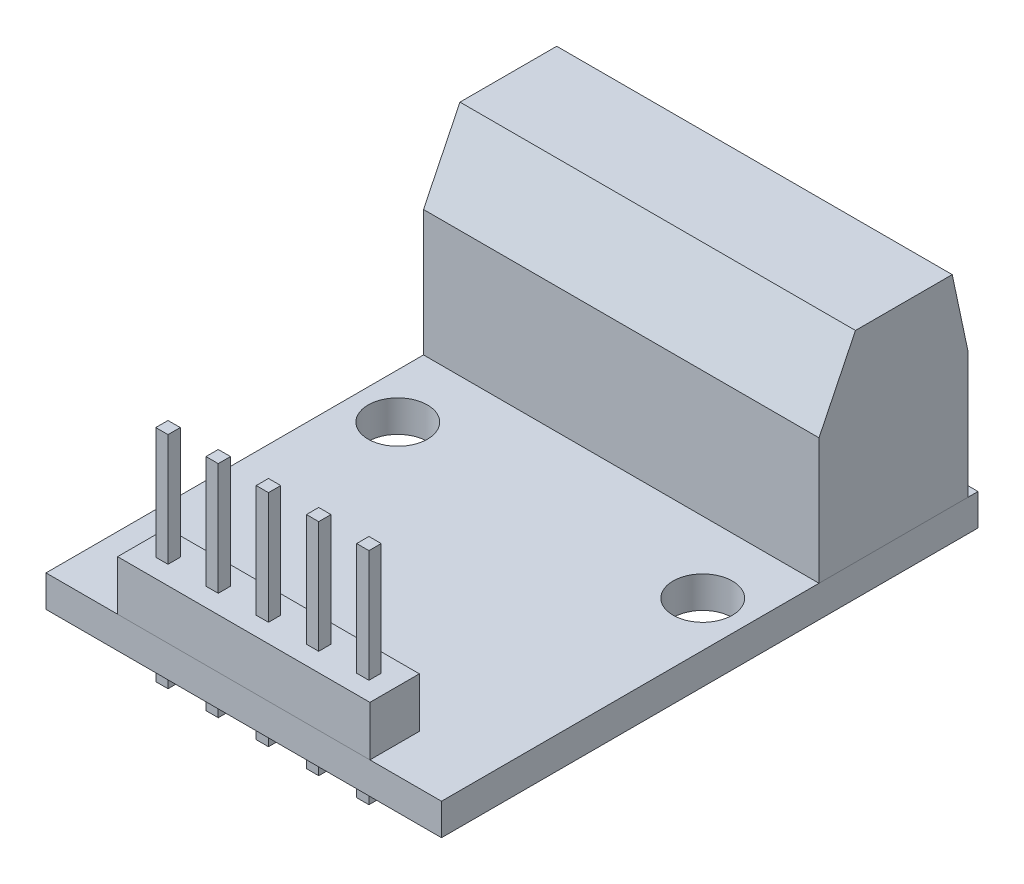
ISO-10303-21;
HEADER;
FILE_DESCRIPTION(('STEP AP214'),'2;1');
FILE_NAME('part.step','',(''),(''),'','','');
FILE_SCHEMA(('AUTOMOTIVE_DESIGN { 1 0 10303 214 1 1 1 1 }'));
ENDSEC;
DATA;
#1=APPLICATION_CONTEXT('core data for automotive mechanical design processes');
#2=APPLICATION_PROTOCOL_DEFINITION('international standard','automotive_design',2000,#1);
#3=PRODUCT_CONTEXT('',#1,'mechanical');
#4=PRODUCT('Part','Part','',(#3));
#5=PRODUCT_RELATED_PRODUCT_CATEGORY('part','',(#4));
#6=PRODUCT_DEFINITION_FORMATION('','',#4);
#7=PRODUCT_DEFINITION_CONTEXT('part definition',#1,'design');
#8=PRODUCT_DEFINITION('design','',#6,#7);
#9=PRODUCT_DEFINITION_SHAPE('','',#8);
#10=(LENGTH_UNIT() NAMED_UNIT(*) SI_UNIT(.MILLI.,.METRE.));
#11=(NAMED_UNIT(*) PLANE_ANGLE_UNIT() SI_UNIT($,.RADIAN.));
#12=(NAMED_UNIT(*) SI_UNIT($,.STERADIAN.) SOLID_ANGLE_UNIT());
#13=UNCERTAINTY_MEASURE_WITH_UNIT(LENGTH_MEASURE(1.E-05),#10,'distance_accuracy_value','');
#14=(GEOMETRIC_REPRESENTATION_CONTEXT(3) GLOBAL_UNCERTAINTY_ASSIGNED_CONTEXT((#13)) GLOBAL_UNIT_ASSIGNED_CONTEXT((#10,
#11,#12)) REPRESENTATION_CONTEXT('',''));
#15=CARTESIAN_POINT('',(0.,0.,0.));
#16=DIRECTION('',(0.,0.,1.));
#17=DIRECTION('',(1.,0.,0.));
#18=AXIS2_PLACEMENT_3D('',#15,#16,#17);
#19=CARTESIAN_POINT('',(-10.,11.75,-5.525));
#20=DIRECTION('',(1.,0.,0.));
#21=DIRECTION('',(0.,0.,-1.));
#22=AXIS2_PLACEMENT_3D('',#19,#20,#21);
#23=PLANE('',#22);
#24=DIRECTION('',(0.,-1.,0.));
#25=VECTOR('',#24,1.);
#26=CARTESIAN_POINT('',(-10.,11.75,-5.525));
#27=LINE('',#26,#25);
#28=CARTESIAN_POINT('',(-10.,7.96999999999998,-5.525));
#29=VERTEX_POINT('',#28);
#30=CARTESIAN_POINT('',(-10.,1.6,-5.525));
#31=VERTEX_POINT('',#30);
#32=EDGE_CURVE('E427',#29,#31,#27,.T.);
#33=ORIENTED_EDGE('',*,*,#32,.F.);
#34=DIRECTION('',(0.,0.898794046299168,-0.438371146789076));
#35=VECTOR('',#34,1.);
#36=CARTESIAN_POINT('',(-10.,11.75,-7.36862918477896));
#37=LINE('',#36,#35);
#38=CARTESIAN_POINT('',(-10.,11.75,-7.36862918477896));
#39=VERTEX_POINT('',#38);
#40=EDGE_CURVE('E12',#29,#39,#37,.T.);
#41=ORIENTED_EDGE('',*,*,#40,.T.);
#42=DIRECTION('',(0.,0.,1.));
#43=VECTOR('',#42,1.);
#44=CARTESIAN_POINT('',(-10.,11.75,-5.525));
#45=LINE('',#44,#43);
#46=CARTESIAN_POINT('',(-10.,11.75,-12.2615361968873));
#47=VERTEX_POINT('',#46);
#48=EDGE_CURVE('E396',#47,#39,#45,.T.);
#49=ORIENTED_EDGE('',*,*,#48,.F.);
#50=DIRECTION('',(0.,-0.978147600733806,-0.207911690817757));
#51=VECTOR('',#50,1.);
#52=CARTESIAN_POINT('',(-10.,11.75,-12.2615361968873));
#53=LINE('',#52,#51);
#54=CARTESIAN_POINT('',(-10.,7.96999999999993,-13.065));
#55=VERTEX_POINT('',#54);
#56=EDGE_CURVE('E434',#47,#55,#53,.T.);
#57=ORIENTED_EDGE('',*,*,#56,.T.);
#58=DIRECTION('',(0.,-1.,0.));
#59=VECTOR('',#58,1.);
#60=CARTESIAN_POINT('',(-10.,11.75,-13.065));
#61=LINE('',#60,#59);
#62=CARTESIAN_POINT('',(-10.,1.6,-13.065));
#63=VERTEX_POINT('',#62);
#64=EDGE_CURVE('E404',#55,#63,#61,.T.);
#65=ORIENTED_EDGE('',*,*,#64,.T.);
#66=DIRECTION('',(0.,0.,1.));
#67=VECTOR('',#66,1.);
#68=CARTESIAN_POINT('',(-10.,1.6,-5.525));
#69=LINE('',#68,#67);
#70=EDGE_CURVE('E255',#63,#31,#69,.T.);
#71=ORIENTED_EDGE('',*,*,#70,.T.);
#72=EDGE_LOOP('',(#33,#41,#49,#57,#65,#71));
#73=FACE_BOUND('',#72,.T.);
#74=ADVANCED_FACE('F56',(#73),#23,.F.);
#75=CARTESIAN_POINT('',(10.,11.75,-5.525));
#76=DIRECTION('',(0.,0.,-1.));
#77=DIRECTION('',(-1.,0.,0.));
#78=AXIS2_PLACEMENT_3D('',#75,#76,#77);
#79=PLANE('',#78);
#80=DIRECTION('',(0.,-1.,0.));
#81=VECTOR('',#80,1.);
#82=CARTESIAN_POINT('',(10.,11.75,-5.525));
#83=LINE('',#82,#81);
#84=CARTESIAN_POINT('',(10.,7.96999999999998,-5.525));
#85=VERTEX_POINT('',#84);
#86=CARTESIAN_POINT('',(10.,1.6,-5.525));
#87=VERTEX_POINT('',#86);
#88=EDGE_CURVE('E424',#85,#87,#83,.T.);
#89=ORIENTED_EDGE('',*,*,#88,.F.);
#90=DIRECTION('',(-1.,0.,0.));
#91=VECTOR('',#90,1.);
#92=CARTESIAN_POINT('',(-10.,7.96999999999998,-5.525));
#93=LINE('',#92,#91);
#94=EDGE_CURVE('E66',#85,#29,#93,.T.);
#95=ORIENTED_EDGE('',*,*,#94,.T.);
#96=ORIENTED_EDGE('',*,*,#32,.T.);
#97=DIRECTION('',(1.,0.,0.));
#98=VECTOR('',#97,1.);
#99=CARTESIAN_POINT('',(10.,1.6,-5.525));
#100=LINE('',#99,#98);
#101=EDGE_CURVE('E408',#31,#87,#100,.T.);
#102=ORIENTED_EDGE('',*,*,#101,.T.);
#103=EDGE_LOOP('',(#89,#95,#96,#102));
#104=FACE_BOUND('',#103,.T.);
#105=ADVANCED_FACE('F484',(#104),#79,.F.);
#106=CARTESIAN_POINT('',(10.,11.75,-5.525));
#107=DIRECTION('',(-1.,0.,0.));
#108=DIRECTION('',(0.,0.,1.));
#109=AXIS2_PLACEMENT_3D('',#106,#107,#108);
#110=PLANE('',#109);
#111=DIRECTION('',(0.,0.,-1.));
#112=VECTOR('',#111,1.);
#113=CARTESIAN_POINT('',(10.,11.75,-5.525));
#114=LINE('',#113,#112);
#115=CARTESIAN_POINT('',(10.,11.75,-7.36862918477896));
#116=VERTEX_POINT('',#115);
#117=CARTESIAN_POINT('',(10.,11.75,-12.2615361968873));
#118=VERTEX_POINT('',#117);
#119=EDGE_CURVE('E400',#116,#118,#114,.T.);
#120=ORIENTED_EDGE('',*,*,#119,.F.);
#121=DIRECTION('',(0.,-0.898794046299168,0.438371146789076));
#122=VECTOR('',#121,1.);
#123=CARTESIAN_POINT('',(10.,11.75,-7.36862918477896));
#124=LINE('',#123,#122);
#125=EDGE_CURVE('E80',#116,#85,#124,.T.);
#126=ORIENTED_EDGE('',*,*,#125,.T.);
#127=ORIENTED_EDGE('',*,*,#88,.T.);
#128=DIRECTION('',(0.,0.,-1.));
#129=VECTOR('',#128,1.);
#130=CARTESIAN_POINT('',(10.,1.6,-5.525));
#131=LINE('',#130,#129);
#132=CARTESIAN_POINT('',(10.,1.6,-13.065));
#133=VERTEX_POINT('',#132);
#134=EDGE_CURVE('E412',#87,#133,#131,.T.);
#135=ORIENTED_EDGE('',*,*,#134,.T.);
#136=DIRECTION('',(0.,-1.,0.));
#137=VECTOR('',#136,1.);
#138=CARTESIAN_POINT('',(10.,11.75,-13.065));
#139=LINE('',#138,#137);
#140=CARTESIAN_POINT('',(10.,7.96999999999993,-13.065));
#141=VERTEX_POINT('',#140);
#142=EDGE_CURVE('E421',#141,#133,#139,.T.);
#143=ORIENTED_EDGE('',*,*,#142,.F.);
#144=DIRECTION('',(0.,0.978147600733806,0.207911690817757));
#145=VECTOR('',#144,1.);
#146=CARTESIAN_POINT('',(10.,11.75,-12.2615361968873));
#147=LINE('',#146,#145);
#148=EDGE_CURVE('E452',#141,#118,#147,.T.);
#149=ORIENTED_EDGE('',*,*,#148,.T.);
#150=EDGE_LOOP('',(#120,#126,#127,#135,#143,#149));
#151=FACE_BOUND('',#150,.T.);
#152=ADVANCED_FACE('F468',(#151),#110,.F.);
#153=CARTESIAN_POINT('',(10.,11.75,-13.065));
#154=DIRECTION('',(0.,0.,1.));
#155=DIRECTION('',(1.,0.,0.));
#156=AXIS2_PLACEMENT_3D('',#153,#154,#155);
#157=PLANE('',#156);
#158=ORIENTED_EDGE('',*,*,#64,.F.);
#159=DIRECTION('',(1.,0.,0.));
#160=VECTOR('',#159,1.);
#161=CARTESIAN_POINT('',(10.,7.96999999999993,-13.065));
#162=LINE('',#161,#160);
#163=CARTESIAN_POINT('',(-9.28,7.97,-13.065));
#164=VERTEX_POINT('',#163);
#165=EDGE_CURVE('E449',#55,#164,#162,.T.);
#166=ORIENTED_EDGE('',*,*,#165,.T.);
#167=DIRECTION('',(0.,1.,0.));
#168=VECTOR('',#167,1.);
#169=CARTESIAN_POINT('',(-9.28,7.97,-13.065));
#170=LINE('',#169,#168);
#171=CARTESIAN_POINT('',(-9.28,2.37,-13.065));
#172=VERTEX_POINT('',#171);
#173=EDGE_CURVE('E371',#172,#164,#170,.T.);
#174=ORIENTED_EDGE('',*,*,#173,.F.);
#175=DIRECTION('',(-1.,0.,0.));
#176=VECTOR('',#175,1.);
#177=CARTESIAN_POINT('',(-5.18,2.37,-13.065));
#178=LINE('',#177,#176);
#179=CARTESIAN_POINT('',(-5.18,2.37,-13.065));
#180=VERTEX_POINT('',#179);
#181=EDGE_CURVE('E376',#180,#172,#178,.T.);
#182=ORIENTED_EDGE('',*,*,#181,.F.);
#183=DIRECTION('',(0.,-1.,0.));
#184=VECTOR('',#183,1.);
#185=CARTESIAN_POINT('',(-5.18,7.97,-13.065));
#186=LINE('',#185,#184);
#187=CARTESIAN_POINT('',(-5.18,7.97,-13.065));
#188=VERTEX_POINT('',#187);
#189=EDGE_CURVE('E322',#188,#180,#186,.T.);
#190=ORIENTED_EDGE('',*,*,#189,.F.);
#191=DIRECTION('',(1.,0.,0.));
#192=VECTOR('',#191,1.);
#193=CARTESIAN_POINT('',(10.,7.96999999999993,-13.065));
#194=LINE('',#193,#192);
#195=CARTESIAN_POINT('',(-4.46,7.97,-13.065));
#196=VERTEX_POINT('',#195);
#197=EDGE_CURVE('E446',#188,#196,#194,.T.);
#198=ORIENTED_EDGE('',*,*,#197,.T.);
#199=DIRECTION('',(0.,1.,0.));
#200=VECTOR('',#199,1.);
#201=CARTESIAN_POINT('',(-4.46,7.97,-13.065));
#202=LINE('',#201,#200);
#203=CARTESIAN_POINT('',(-4.46,2.37,-13.065));
#204=VERTEX_POINT('',#203);
#205=EDGE_CURVE('E327',#204,#196,#202,.T.);
#206=ORIENTED_EDGE('',*,*,#205,.F.);
#207=DIRECTION('',(-1.,0.,0.));
#208=VECTOR('',#207,1.);
#209=CARTESIAN_POINT('',(-0.360000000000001,2.37,-13.065));
#210=LINE('',#209,#208);
#211=CARTESIAN_POINT('',(-0.360000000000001,2.37,-13.065));
#212=VERTEX_POINT('',#211);
#213=EDGE_CURVE('E332',#212,#204,#210,.T.);
#214=ORIENTED_EDGE('',*,*,#213,.F.);
#215=DIRECTION('',(0.,-1.,0.));
#216=VECTOR('',#215,1.);
#217=CARTESIAN_POINT('',(-0.360000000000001,7.97,-13.065));
#218=LINE('',#217,#216);
#219=CARTESIAN_POINT('',(-0.360000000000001,7.97,-13.065));
#220=VERTEX_POINT('',#219);
#221=EDGE_CURVE('E277',#220,#212,#218,.T.);
#222=ORIENTED_EDGE('',*,*,#221,.F.);
#223=DIRECTION('',(1.,0.,0.));
#224=VECTOR('',#223,1.);
#225=CARTESIAN_POINT('',(10.,7.96999999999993,-13.065));
#226=LINE('',#225,#224);
#227=CARTESIAN_POINT('',(0.359999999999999,7.97,-13.065));
#228=VERTEX_POINT('',#227);
#229=EDGE_CURVE('E443',#220,#228,#226,.T.);
#230=ORIENTED_EDGE('',*,*,#229,.T.);
#231=DIRECTION('',(0.,1.,0.));
#232=VECTOR('',#231,1.);
#233=CARTESIAN_POINT('',(0.359999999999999,7.97,-13.065));
#234=LINE('',#233,#232);
#235=CARTESIAN_POINT('',(0.359999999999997,2.37,-13.065));
#236=VERTEX_POINT('',#235);
#237=EDGE_CURVE('E282',#236,#228,#234,.T.);
#238=ORIENTED_EDGE('',*,*,#237,.F.);
#239=DIRECTION('',(-1.,0.,0.));
#240=VECTOR('',#239,1.);
#241=CARTESIAN_POINT('',(4.46,2.37,-13.065));
#242=LINE('',#241,#240);
#243=CARTESIAN_POINT('',(4.46,2.37,-13.065));
#244=VERTEX_POINT('',#243);
#245=EDGE_CURVE('E287',#244,#236,#242,.T.);
#246=ORIENTED_EDGE('',*,*,#245,.F.);
#247=DIRECTION('',(0.,-1.,0.));
#248=VECTOR('',#247,1.);
#249=CARTESIAN_POINT('',(4.46,7.97,-13.065));
#250=LINE('',#249,#248);
#251=CARTESIAN_POINT('',(4.46,7.97,-13.065));
#252=VERTEX_POINT('',#251);
#253=EDGE_CURVE('E246',#252,#244,#250,.T.);
#254=ORIENTED_EDGE('',*,*,#253,.F.);
#255=DIRECTION('',(1.,0.,0.));
#256=VECTOR('',#255,1.);
#257=CARTESIAN_POINT('',(10.,7.96999999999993,-13.065));
#258=LINE('',#257,#256);
#259=CARTESIAN_POINT('',(5.18,7.97,-13.065));
#260=VERTEX_POINT('',#259);
#261=EDGE_CURVE('E440',#252,#260,#258,.T.);
#262=ORIENTED_EDGE('',*,*,#261,.T.);
#263=DIRECTION('',(0.,1.,0.));
#264=VECTOR('',#263,1.);
#265=CARTESIAN_POINT('',(5.18,7.97,-13.065));
#266=LINE('',#265,#264);
#267=CARTESIAN_POINT('',(5.18,2.37,-13.065));
#268=VERTEX_POINT('',#267);
#269=EDGE_CURVE('E236',#268,#260,#266,.T.);
#270=ORIENTED_EDGE('',*,*,#269,.F.);
#271=DIRECTION('',(-1.,0.,0.));
#272=VECTOR('',#271,1.);
#273=CARTESIAN_POINT('',(9.28,2.37,-13.065));
#274=LINE('',#273,#272);
#275=CARTESIAN_POINT('',(9.28,2.37,-13.065));
#276=VERTEX_POINT('',#275);
#277=EDGE_CURVE('E245',#276,#268,#274,.T.);
#278=ORIENTED_EDGE('',*,*,#277,.F.);
#279=DIRECTION('',(0.,-1.,0.));
#280=VECTOR('',#279,1.);
#281=CARTESIAN_POINT('',(9.28,7.97,-13.065));
#282=LINE('',#281,#280);
#283=CARTESIAN_POINT('',(9.28,7.97,-13.065));
#284=VERTEX_POINT('',#283);
#285=EDGE_CURVE('E212',#284,#276,#282,.T.);
#286=ORIENTED_EDGE('',*,*,#285,.F.);
#287=DIRECTION('',(1.,0.,0.));
#288=VECTOR('',#287,1.);
#289=CARTESIAN_POINT('',(10.,7.96999999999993,-13.065));
#290=LINE('',#289,#288);
#291=EDGE_CURVE('E437',#284,#141,#290,.T.);
#292=ORIENTED_EDGE('',*,*,#291,.T.);
#293=ORIENTED_EDGE('',*,*,#142,.T.);
#294=DIRECTION('',(-1.,0.,0.));
#295=VECTOR('',#294,1.);
#296=CARTESIAN_POINT('',(10.,1.6,-13.065));
#297=LINE('',#296,#295);
#298=EDGE_CURVE('E401',#133,#63,#297,.T.);
#299=ORIENTED_EDGE('',*,*,#298,.T.);
#300=EDGE_LOOP('',(#158,#166,#174,#182,#190,#198,#206,#214,#222,#230,#238,#246,#254,#262,#270,
#278,#286,#292,#293,#299));
#301=FACE_BOUND('',#300,.T.);
#302=ADVANCED_FACE('F498',(#301),#157,.F.);
#303=CARTESIAN_POINT('',(0.,11.75,0.));
#304=DIRECTION('',(0.,1.,0.));
#305=DIRECTION('',(0.,0.,1.));
#306=AXIS2_PLACEMENT_3D('',#303,#304,#305);
#307=PLANE('',#306);
#308=ORIENTED_EDGE('',*,*,#48,.T.);
#309=DIRECTION('',(1.,0.,0.));
#310=VECTOR('',#309,1.);
#311=CARTESIAN_POINT('',(10.,11.75,-7.36862918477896));
#312=LINE('',#311,#310);
#313=EDGE_CURVE('E456',#39,#116,#312,.T.);
#314=ORIENTED_EDGE('',*,*,#313,.T.);
#315=ORIENTED_EDGE('',*,*,#119,.T.);
#316=DIRECTION('',(-1.,0.,0.));
#317=VECTOR('',#316,1.);
#318=CARTESIAN_POINT('',(-10.,11.75,-12.2615361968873));
#319=LINE('',#318,#317);
#320=EDGE_CURVE('E430',#118,#47,#319,.T.);
#321=ORIENTED_EDGE('',*,*,#320,.T.);
#322=EDGE_LOOP('',(#308,#314,#315,#321));
#323=FACE_BOUND('',#322,.T.);
#324=ADVANCED_FACE('F464',(#323),#307,.T.);
#325=CARTESIAN_POINT('',(0.,1.6,0.));
#326=DIRECTION('',(0.,1.,0.));
#327=DIRECTION('',(0.,0.,1.));
#328=AXIS2_PLACEMENT_3D('',#325,#326,#327);
#329=PLANE('',#328);
#330=ORIENTED_EDGE('',*,*,#70,.F.);
#331=ORIENTED_EDGE('',*,*,#298,.F.);
#332=ORIENTED_EDGE('',*,*,#134,.F.);
#333=ORIENTED_EDGE('',*,*,#101,.F.);
#334=EDGE_LOOP('',(#330,#331,#332,#333));
#335=FACE_BOUND('',#334,.T.);
#336=ADVANCED_FACE('F502',(#335),#329,.F.);
#337=CARTESIAN_POINT('',(-5.18,7.97,-9.065));
#338=DIRECTION('',(1.,0.,0.));
#339=DIRECTION('',(0.,0.,-1.));
#340=AXIS2_PLACEMENT_3D('',#337,#338,#339);
#341=PLANE('',#340);
#342=ORIENTED_EDGE('',*,*,#189,.T.);
#343=DIRECTION('',(0.,0.,-1.));
#344=VECTOR('',#343,1.);
#345=CARTESIAN_POINT('',(-5.18,2.37,-9.065));
#346=LINE('',#345,#344);
#347=CARTESIAN_POINT('',(-5.18,2.37,-9.065));
#348=VERTEX_POINT('',#347);
#349=EDGE_CURVE('E352',#348,#180,#346,.T.);
#350=ORIENTED_EDGE('',*,*,#349,.F.);
#351=DIRECTION('',(0.,-1.,0.));
#352=VECTOR('',#351,1.);
#353=CARTESIAN_POINT('',(-5.18,7.97,-9.065));
#354=LINE('',#353,#352);
#355=CARTESIAN_POINT('',(-5.18,7.97,-9.065));
#356=VERTEX_POINT('',#355);
#357=EDGE_CURVE('E372',#356,#348,#354,.T.);
#358=ORIENTED_EDGE('',*,*,#357,.F.);
#359=DIRECTION('',(0.,0.,-1.));
#360=VECTOR('',#359,1.);
#361=CARTESIAN_POINT('',(-5.18,7.97,-9.065));
#362=LINE('',#361,#360);
#363=EDGE_CURVE('E364',#356,#188,#362,.T.);
#364=ORIENTED_EDGE('',*,*,#363,.T.);
#365=EDGE_LOOP('',(#342,#350,#358,#364));
#366=FACE_BOUND('',#365,.T.);
#367=ADVANCED_FACE('F505',(#366),#341,.F.);
#368=CARTESIAN_POINT('',(-5.18,7.97,-9.065));
#369=DIRECTION('',(0.,1.,0.));
#370=DIRECTION('',(0.,0.,1.));
#371=AXIS2_PLACEMENT_3D('',#368,#369,#370);
#372=PLANE('',#371);
#373=DIRECTION('',(1.,0.,0.));
#374=VECTOR('',#373,1.);
#375=CARTESIAN_POINT('',(-5.18,7.97,-13.065));
#376=LINE('',#375,#374);
#377=EDGE_CURVE('E367',#164,#188,#376,.T.);
#378=ORIENTED_EDGE('',*,*,#377,.T.);
#379=ORIENTED_EDGE('',*,*,#363,.F.);
#380=DIRECTION('',(1.,0.,0.));
#381=VECTOR('',#380,1.);
#382=CARTESIAN_POINT('',(-5.18,7.97,-9.065));
#383=LINE('',#382,#381);
#384=CARTESIAN_POINT('',(-9.28,7.97,-9.065));
#385=VERTEX_POINT('',#384);
#386=EDGE_CURVE('E356',#385,#356,#383,.T.);
#387=ORIENTED_EDGE('',*,*,#386,.F.);
#388=DIRECTION('',(0.,0.,-1.));
#389=VECTOR('',#388,1.);
#390=CARTESIAN_POINT('',(-9.28,7.97,-9.065));
#391=LINE('',#390,#389);
#392=EDGE_CURVE('E360',#385,#164,#391,.T.);
#393=ORIENTED_EDGE('',*,*,#392,.T.);
#394=EDGE_LOOP('',(#378,#379,#387,#393));
#395=FACE_BOUND('',#394,.T.);
#396=ADVANCED_FACE('F515',(#395),#372,.F.);
#397=CARTESIAN_POINT('',(-9.28,7.97,-9.065));
#398=DIRECTION('',(-1.,0.,0.));
#399=DIRECTION('',(0.,-1.,0.));
#400=AXIS2_PLACEMENT_3D('',#397,#398,#399);
#401=PLANE('',#400);
#402=ORIENTED_EDGE('',*,*,#173,.T.);
#403=ORIENTED_EDGE('',*,*,#392,.F.);
#404=DIRECTION('',(0.,1.,0.));
#405=VECTOR('',#404,1.);
#406=CARTESIAN_POINT('',(-9.28,7.97,-9.065));
#407=LINE('',#406,#405);
#408=CARTESIAN_POINT('',(-9.28,2.37,-9.065));
#409=VERTEX_POINT('',#408);
#410=EDGE_CURVE('E385',#409,#385,#407,.T.);
#411=ORIENTED_EDGE('',*,*,#410,.F.);
#412=DIRECTION('',(0.,0.,-1.));
#413=VECTOR('',#412,1.);
#414=CARTESIAN_POINT('',(-9.28,2.37,-9.065));
#415=LINE('',#414,#413);
#416=EDGE_CURVE('E357',#409,#172,#415,.T.);
#417=ORIENTED_EDGE('',*,*,#416,.T.);
#418=EDGE_LOOP('',(#402,#403,#411,#417));
#419=FACE_BOUND('',#418,.T.);
#420=ADVANCED_FACE('F518',(#419),#401,.F.);
#421=CARTESIAN_POINT('',(-5.18,2.37,-9.065));
#422=DIRECTION('',(0.,-1.,0.));
#423=DIRECTION('',(1.,0.,0.));
#424=AXIS2_PLACEMENT_3D('',#421,#422,#423);
#425=PLANE('',#424);
#426=ORIENTED_EDGE('',*,*,#181,.T.);
#427=ORIENTED_EDGE('',*,*,#416,.F.);
#428=DIRECTION('',(-1.,0.,0.));
#429=VECTOR('',#428,1.);
#430=CARTESIAN_POINT('',(-5.18,2.37,-9.065));
#431=LINE('',#430,#429);
#432=EDGE_CURVE('E389',#348,#409,#431,.T.);
#433=ORIENTED_EDGE('',*,*,#432,.F.);
#434=ORIENTED_EDGE('',*,*,#349,.T.);
#435=EDGE_LOOP('',(#426,#427,#433,#434));
#436=FACE_BOUND('',#435,.T.);
#437=ADVANCED_FACE('F513',(#436),#425,.F.);
#438=CARTESIAN_POINT('',(0.,0.,-9.065));
#439=DIRECTION('',(0.,0.,-1.));
#440=DIRECTION('',(-1.,0.,0.));
#441=AXIS2_PLACEMENT_3D('',#438,#439,#440);
#442=PLANE('',#441);
#443=ORIENTED_EDGE('',*,*,#357,.T.);
#444=ORIENTED_EDGE('',*,*,#432,.T.);
#445=ORIENTED_EDGE('',*,*,#410,.T.);
#446=ORIENTED_EDGE('',*,*,#386,.T.);
#447=EDGE_LOOP('',(#443,#444,#445,#446));
#448=FACE_BOUND('',#447,.T.);
#449=ADVANCED_FACE('F509',(#448),#442,.T.);
#450=CARTESIAN_POINT('',(-0.360000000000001,7.97,-9.065));
#451=DIRECTION('',(1.,0.,0.));
#452=DIRECTION('',(0.,0.,-1.));
#453=AXIS2_PLACEMENT_3D('',#450,#451,#452);
#454=PLANE('',#453);
#455=ORIENTED_EDGE('',*,*,#221,.T.);
#456=DIRECTION('',(0.,0.,-1.));
#457=VECTOR('',#456,1.);
#458=CARTESIAN_POINT('',(-0.360000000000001,2.37,-9.065));
#459=LINE('',#458,#457);
#460=CARTESIAN_POINT('',(-0.360000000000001,2.37,-9.065));
#461=VERTEX_POINT('',#460);
#462=EDGE_CURVE('E307',#461,#212,#459,.T.);
#463=ORIENTED_EDGE('',*,*,#462,.F.);
#464=DIRECTION('',(0.,-1.,0.));
#465=VECTOR('',#464,1.);
#466=CARTESIAN_POINT('',(-0.360000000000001,7.97,-9.065));
#467=LINE('',#466,#465);
#468=CARTESIAN_POINT('',(-0.360000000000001,7.97,-9.065));
#469=VERTEX_POINT('',#468);
#470=EDGE_CURVE('E328',#469,#461,#467,.T.);
#471=ORIENTED_EDGE('',*,*,#470,.F.);
#472=DIRECTION('',(0.,0.,-1.));
#473=VECTOR('',#472,1.);
#474=CARTESIAN_POINT('',(-0.360000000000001,7.97,-9.065));
#475=LINE('',#474,#473);
#476=EDGE_CURVE('E319',#469,#220,#475,.T.);
#477=ORIENTED_EDGE('',*,*,#476,.T.);
#478=EDGE_LOOP('',(#455,#463,#471,#477));
#479=FACE_BOUND('',#478,.T.);
#480=ADVANCED_FACE('F512',(#479),#454,.F.);
#481=CARTESIAN_POINT('',(-0.360000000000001,7.97,-9.065));
#482=DIRECTION('',(0.,1.,0.));
#483=DIRECTION('',(0.,0.,1.));
#484=AXIS2_PLACEMENT_3D('',#481,#482,#483);
#485=PLANE('',#484);
#486=DIRECTION('',(1.,0.,0.));
#487=VECTOR('',#486,1.);
#488=CARTESIAN_POINT('',(-0.360000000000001,7.97,-13.065));
#489=LINE('',#488,#487);
#490=EDGE_CURVE('E323',#196,#220,#489,.T.);
#491=ORIENTED_EDGE('',*,*,#490,.T.);
#492=ORIENTED_EDGE('',*,*,#476,.F.);
#493=DIRECTION('',(1.,0.,0.));
#494=VECTOR('',#493,1.);
#495=CARTESIAN_POINT('',(-0.360000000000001,7.97,-9.065));
#496=LINE('',#495,#494);
#497=CARTESIAN_POINT('',(-4.46,7.97,-9.065));
#498=VERTEX_POINT('',#497);
#499=EDGE_CURVE('E311',#498,#469,#496,.T.);
#500=ORIENTED_EDGE('',*,*,#499,.F.);
#501=DIRECTION('',(0.,0.,-1.));
#502=VECTOR('',#501,1.);
#503=CARTESIAN_POINT('',(-4.46,7.97,-9.065));
#504=LINE('',#503,#502);
#505=EDGE_CURVE('E315',#498,#196,#504,.T.);
#506=ORIENTED_EDGE('',*,*,#505,.T.);
#507=EDGE_LOOP('',(#491,#492,#500,#506));
#508=FACE_BOUND('',#507,.T.);
#509=ADVANCED_FACE('F535',(#508),#485,.F.);
#510=CARTESIAN_POINT('',(-4.46,7.97,-9.065));
#511=DIRECTION('',(-1.,0.,0.));
#512=DIRECTION('',(0.,-1.,0.));
#513=AXIS2_PLACEMENT_3D('',#510,#511,#512);
#514=PLANE('',#513);
#515=ORIENTED_EDGE('',*,*,#205,.T.);
#516=ORIENTED_EDGE('',*,*,#505,.F.);
#517=DIRECTION('',(0.,1.,0.));
#518=VECTOR('',#517,1.);
#519=CARTESIAN_POINT('',(-4.46,7.97,-9.065));
#520=LINE('',#519,#518);
#521=CARTESIAN_POINT('',(-4.46,2.37,-9.065));
#522=VERTEX_POINT('',#521);
#523=EDGE_CURVE('E341',#522,#498,#520,.T.);
#524=ORIENTED_EDGE('',*,*,#523,.F.);
#525=DIRECTION('',(0.,0.,-1.));
#526=VECTOR('',#525,1.);
#527=CARTESIAN_POINT('',(-4.46,2.37,-9.065));
#528=LINE('',#527,#526);
#529=EDGE_CURVE('E312',#522,#204,#528,.T.);
#530=ORIENTED_EDGE('',*,*,#529,.T.);
#531=EDGE_LOOP('',(#515,#516,#524,#530));
#532=FACE_BOUND('',#531,.T.);
#533=ADVANCED_FACE('F538',(#532),#514,.F.);
#534=CARTESIAN_POINT('',(-0.360000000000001,2.37,-9.065));
#535=DIRECTION('',(0.,-1.,0.));
#536=DIRECTION('',(1.,0.,0.));
#537=AXIS2_PLACEMENT_3D('',#534,#535,#536);
#538=PLANE('',#537);
#539=ORIENTED_EDGE('',*,*,#213,.T.);
#540=ORIENTED_EDGE('',*,*,#529,.F.);
#541=DIRECTION('',(-1.,0.,0.));
#542=VECTOR('',#541,1.);
#543=CARTESIAN_POINT('',(-0.360000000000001,2.37,-9.065));
#544=LINE('',#543,#542);
#545=EDGE_CURVE('E345',#461,#522,#544,.T.);
#546=ORIENTED_EDGE('',*,*,#545,.F.);
#547=ORIENTED_EDGE('',*,*,#462,.T.);
#548=EDGE_LOOP('',(#539,#540,#546,#547));
#549=FACE_BOUND('',#548,.T.);
#550=ADVANCED_FACE('F533',(#549),#538,.F.);
#551=CARTESIAN_POINT('',(0.,0.,-9.065));
#552=DIRECTION('',(0.,0.,-1.));
#553=DIRECTION('',(-1.,0.,0.));
#554=AXIS2_PLACEMENT_3D('',#551,#552,#553);
#555=PLANE('',#554);
#556=ORIENTED_EDGE('',*,*,#470,.T.);
#557=ORIENTED_EDGE('',*,*,#545,.T.);
#558=ORIENTED_EDGE('',*,*,#523,.T.);
#559=ORIENTED_EDGE('',*,*,#499,.T.);
#560=EDGE_LOOP('',(#556,#557,#558,#559));
#561=FACE_BOUND('',#560,.T.);
#562=ADVANCED_FACE('F529',(#561),#555,.T.);
#563=CARTESIAN_POINT('',(4.46,7.97,-9.065));
#564=DIRECTION('',(1.,0.,0.));
#565=DIRECTION('',(0.,1.,0.));
#566=AXIS2_PLACEMENT_3D('',#563,#564,#565);
#567=PLANE('',#566);
#568=ORIENTED_EDGE('',*,*,#253,.T.);
#569=DIRECTION('',(0.,0.,-1.));
#570=VECTOR('',#569,1.);
#571=CARTESIAN_POINT('',(4.46,2.37,-9.065));
#572=LINE('',#571,#570);
#573=CARTESIAN_POINT('',(4.46,2.37,-9.065));
#574=VERTEX_POINT('',#573);
#575=EDGE_CURVE('E262',#574,#244,#572,.T.);
#576=ORIENTED_EDGE('',*,*,#575,.F.);
#577=DIRECTION('',(0.,-1.,0.));
#578=VECTOR('',#577,1.);
#579=CARTESIAN_POINT('',(4.46,7.97,-9.065));
#580=LINE('',#579,#578);
#581=CARTESIAN_POINT('',(4.46,7.97,-9.065));
#582=VERTEX_POINT('',#581);
#583=EDGE_CURVE('E283',#582,#574,#580,.T.);
#584=ORIENTED_EDGE('',*,*,#583,.F.);
#585=DIRECTION('',(0.,0.,-1.));
#586=VECTOR('',#585,1.);
#587=CARTESIAN_POINT('',(4.46,7.97,-9.065));
#588=LINE('',#587,#586);
#589=EDGE_CURVE('E274',#582,#252,#588,.T.);
#590=ORIENTED_EDGE('',*,*,#589,.T.);
#591=EDGE_LOOP('',(#568,#576,#584,#590));
#592=FACE_BOUND('',#591,.T.);
#593=ADVANCED_FACE('F532',(#592),#567,.F.);
#594=CARTESIAN_POINT('',(4.46,7.97,-9.065));
#595=DIRECTION('',(0.,1.,0.));
#596=DIRECTION('',(0.,0.,1.));
#597=AXIS2_PLACEMENT_3D('',#594,#595,#596);
#598=PLANE('',#597);
#599=DIRECTION('',(1.,0.,0.));
#600=VECTOR('',#599,1.);
#601=CARTESIAN_POINT('',(4.46,7.97,-13.065));
#602=LINE('',#601,#600);
#603=EDGE_CURVE('E278',#228,#252,#602,.T.);
#604=ORIENTED_EDGE('',*,*,#603,.T.);
#605=ORIENTED_EDGE('',*,*,#589,.F.);
#606=DIRECTION('',(1.,0.,0.));
#607=VECTOR('',#606,1.);
#608=CARTESIAN_POINT('',(4.46,7.97,-9.065));
#609=LINE('',#608,#607);
#610=CARTESIAN_POINT('',(0.359999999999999,7.97,-9.065));
#611=VERTEX_POINT('',#610);
#612=EDGE_CURVE('E266',#611,#582,#609,.T.);
#613=ORIENTED_EDGE('',*,*,#612,.F.);
#614=DIRECTION('',(0.,0.,-1.));
#615=VECTOR('',#614,1.);
#616=CARTESIAN_POINT('',(0.359999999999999,7.97,-9.065));
#617=LINE('',#616,#615);
#618=EDGE_CURVE('E270',#611,#228,#617,.T.);
#619=ORIENTED_EDGE('',*,*,#618,.T.);
#620=EDGE_LOOP('',(#604,#605,#613,#619));
#621=FACE_BOUND('',#620,.T.);
#622=ADVANCED_FACE('F554',(#621),#598,.F.);
#623=CARTESIAN_POINT('',(0.359999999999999,7.97,-9.065));
#624=DIRECTION('',(-1.,0.,0.));
#625=DIRECTION('',(0.,-1.,0.));
#626=AXIS2_PLACEMENT_3D('',#623,#624,#625);
#627=PLANE('',#626);
#628=ORIENTED_EDGE('',*,*,#237,.T.);
#629=ORIENTED_EDGE('',*,*,#618,.F.);
#630=DIRECTION('',(0.,1.,0.));
#631=VECTOR('',#630,1.);
#632=CARTESIAN_POINT('',(0.359999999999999,7.97,-9.065));
#633=LINE('',#632,#631);
#634=CARTESIAN_POINT('',(0.359999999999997,2.37,-9.065));
#635=VERTEX_POINT('',#634);
#636=EDGE_CURVE('E296',#635,#611,#633,.T.);
#637=ORIENTED_EDGE('',*,*,#636,.F.);
#638=DIRECTION('',(0.,0.,-1.));
#639=VECTOR('',#638,1.);
#640=CARTESIAN_POINT('',(0.359999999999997,2.37,-9.065));
#641=LINE('',#640,#639);
#642=EDGE_CURVE('E267',#635,#236,#641,.T.);
#643=ORIENTED_EDGE('',*,*,#642,.T.);
#644=EDGE_LOOP('',(#628,#629,#637,#643));
#645=FACE_BOUND('',#644,.T.);
#646=ADVANCED_FACE('F557',(#645),#627,.F.);
#647=CARTESIAN_POINT('',(4.46,2.37,-9.065));
#648=DIRECTION('',(0.,-1.,0.));
#649=DIRECTION('',(1.,0.,0.));
#650=AXIS2_PLACEMENT_3D('',#647,#648,#649);
#651=PLANE('',#650);
#652=ORIENTED_EDGE('',*,*,#245,.T.);
#653=ORIENTED_EDGE('',*,*,#642,.F.);
#654=DIRECTION('',(-1.,0.,0.));
#655=VECTOR('',#654,1.);
#656=CARTESIAN_POINT('',(4.46,2.37,-9.065));
#657=LINE('',#656,#655);
#658=EDGE_CURVE('E300',#574,#635,#657,.T.);
#659=ORIENTED_EDGE('',*,*,#658,.F.);
#660=ORIENTED_EDGE('',*,*,#575,.T.);
#661=EDGE_LOOP('',(#652,#653,#659,#660));
#662=FACE_BOUND('',#661,.T.);
#663=ADVANCED_FACE('F552',(#662),#651,.F.);
#664=CARTESIAN_POINT('',(0.,0.,-9.065));
#665=DIRECTION('',(0.,0.,-1.));
#666=DIRECTION('',(-1.,0.,0.));
#667=AXIS2_PLACEMENT_3D('',#664,#665,#666);
#668=PLANE('',#667);
#669=ORIENTED_EDGE('',*,*,#583,.T.);
#670=ORIENTED_EDGE('',*,*,#658,.T.);
#671=ORIENTED_EDGE('',*,*,#636,.T.);
#672=ORIENTED_EDGE('',*,*,#612,.T.);
#673=EDGE_LOOP('',(#669,#670,#671,#672));
#674=FACE_BOUND('',#673,.T.);
#675=ADVANCED_FACE('F549',(#674),#668,.T.);
#676=CARTESIAN_POINT('',(9.28,7.97,-9.065));
#677=DIRECTION('',(1.,0.,0.));
#678=DIRECTION('',(0.,0.,-1.));
#679=AXIS2_PLACEMENT_3D('',#676,#677,#678);
#680=PLANE('',#679);
#681=ORIENTED_EDGE('',*,*,#285,.T.);
#682=DIRECTION('',(0.,0.,-1.));
#683=VECTOR('',#682,1.);
#684=CARTESIAN_POINT('',(9.28,2.37,-9.065));
#685=LINE('',#684,#683);
#686=CARTESIAN_POINT('',(9.28,2.37,-9.065));
#687=VERTEX_POINT('',#686);
#688=EDGE_CURVE('E205',#687,#276,#685,.T.);
#689=ORIENTED_EDGE('',*,*,#688,.F.);
#690=DIRECTION('',(0.,-1.,0.));
#691=VECTOR('',#690,1.);
#692=CARTESIAN_POINT('',(9.28,7.97,-9.065));
#693=LINE('',#692,#691);
#694=CARTESIAN_POINT('',(9.28,7.97,-9.065));
#695=VERTEX_POINT('',#694);
#696=EDGE_CURVE('E209',#695,#687,#693,.T.);
#697=ORIENTED_EDGE('',*,*,#696,.F.);
#698=DIRECTION('',(0.,0.,-1.));
#699=VECTOR('',#698,1.);
#700=CARTESIAN_POINT('',(9.28,7.97,-9.065));
#701=LINE('',#700,#699);
#702=EDGE_CURVE('E252',#695,#284,#701,.T.);
#703=ORIENTED_EDGE('',*,*,#702,.T.);
#704=EDGE_LOOP('',(#681,#689,#697,#703));
#705=FACE_BOUND('',#704,.T.);
#706=ADVANCED_FACE('F207',(#705),#680,.F.);
#707=CARTESIAN_POINT('',(9.28,7.97,-9.065));
#708=DIRECTION('',(0.,1.,0.));
#709=DIRECTION('',(0.,0.,1.));
#710=AXIS2_PLACEMENT_3D('',#707,#708,#709);
#711=PLANE('',#710);
#712=DIRECTION('',(1.,0.,0.));
#713=VECTOR('',#712,1.);
#714=CARTESIAN_POINT('',(9.28,7.97,-13.065));
#715=LINE('',#714,#713);
#716=EDGE_CURVE('E232',#260,#284,#715,.T.);
#717=ORIENTED_EDGE('',*,*,#716,.T.);
#718=ORIENTED_EDGE('',*,*,#702,.F.);
#719=DIRECTION('',(1.,0.,0.));
#720=VECTOR('',#719,1.);
#721=CARTESIAN_POINT('',(9.28,7.97,-9.065));
#722=LINE('',#721,#720);
#723=CARTESIAN_POINT('',(5.18,7.97,-9.065));
#724=VERTEX_POINT('',#723);
#725=EDGE_CURVE('E218',#724,#695,#722,.T.);
#726=ORIENTED_EDGE('',*,*,#725,.F.);
#727=DIRECTION('',(0.,0.,-1.));
#728=VECTOR('',#727,1.);
#729=CARTESIAN_POINT('',(5.18,7.97,-9.065));
#730=LINE('',#729,#728);
#731=EDGE_CURVE('E256',#724,#260,#730,.T.);
#732=ORIENTED_EDGE('',*,*,#731,.T.);
#733=EDGE_LOOP('',(#717,#718,#726,#732));
#734=FACE_BOUND('',#733,.T.);
#735=ADVANCED_FACE('F570',(#734),#711,.F.);
#736=CARTESIAN_POINT('',(5.18,7.97,-9.065));
#737=DIRECTION('',(-1.,0.,0.));
#738=DIRECTION('',(0.,-1.,0.));
#739=AXIS2_PLACEMENT_3D('',#736,#737,#738);
#740=PLANE('',#739);
#741=ORIENTED_EDGE('',*,*,#269,.T.);
#742=ORIENTED_EDGE('',*,*,#731,.F.);
#743=DIRECTION('',(0.,1.,0.));
#744=VECTOR('',#743,1.);
#745=CARTESIAN_POINT('',(5.18,7.97,-9.065));
#746=LINE('',#745,#744);
#747=CARTESIAN_POINT('',(5.18,2.37,-9.065));
#748=VERTEX_POINT('',#747);
#749=EDGE_CURVE('E227',#748,#724,#746,.T.);
#750=ORIENTED_EDGE('',*,*,#749,.F.);
#751=DIRECTION('',(0.,0.,-1.));
#752=VECTOR('',#751,1.);
#753=CARTESIAN_POINT('',(5.18,2.37,-9.065));
#754=LINE('',#753,#752);
#755=EDGE_CURVE('E217',#748,#268,#754,.T.);
#756=ORIENTED_EDGE('',*,*,#755,.T.);
#757=EDGE_LOOP('',(#741,#742,#750,#756));
#758=FACE_BOUND('',#757,.T.);
#759=ADVANCED_FACE('F573',(#758),#740,.F.);
#760=CARTESIAN_POINT('',(9.28,2.37,-9.065));
#761=DIRECTION('',(0.,-1.,0.));
#762=DIRECTION('',(1.,0.,0.));
#763=AXIS2_PLACEMENT_3D('',#760,#761,#762);
#764=PLANE('',#763);
#765=ORIENTED_EDGE('',*,*,#277,.T.);
#766=ORIENTED_EDGE('',*,*,#755,.F.);
#767=DIRECTION('',(-1.,0.,0.));
#768=VECTOR('',#767,1.);
#769=CARTESIAN_POINT('',(9.28,2.37,-9.065));
#770=LINE('',#769,#768);
#771=EDGE_CURVE('E221',#687,#748,#770,.T.);
#772=ORIENTED_EDGE('',*,*,#771,.F.);
#773=ORIENTED_EDGE('',*,*,#688,.T.);
#774=EDGE_LOOP('',(#765,#766,#772,#773));
#775=FACE_BOUND('',#774,.T.);
#776=ADVANCED_FACE('F222',(#775),#764,.F.);
#777=CARTESIAN_POINT('',(0.,0.,-9.065));
#778=DIRECTION('',(0.,0.,-1.));
#779=DIRECTION('',(-1.,0.,0.));
#780=AXIS2_PLACEMENT_3D('',#777,#778,#779);
#781=PLANE('',#780);
#782=ORIENTED_EDGE('',*,*,#696,.T.);
#783=ORIENTED_EDGE('',*,*,#771,.T.);
#784=ORIENTED_EDGE('',*,*,#749,.T.);
#785=ORIENTED_EDGE('',*,*,#725,.T.);
#786=EDGE_LOOP('',(#782,#783,#784,#785));
#787=FACE_BOUND('',#786,.T.);
#788=ADVANCED_FACE('F229',(#787),#781,.T.);
#789=CARTESIAN_POINT('',(0.,11.75,-12.2615361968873));
#790=DIRECTION('',(0.,0.207911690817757,-0.978147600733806));
#791=DIRECTION('',(1.,0.,0.));
#792=AXIS2_PLACEMENT_3D('',#789,#790,#791);
#793=PLANE('',#792);
#794=ORIENTED_EDGE('',*,*,#377,.F.);
#795=ORIENTED_EDGE('',*,*,#165,.F.);
#796=ORIENTED_EDGE('',*,*,#56,.F.);
#797=ORIENTED_EDGE('',*,*,#320,.F.);
#798=ORIENTED_EDGE('',*,*,#148,.F.);
#799=ORIENTED_EDGE('',*,*,#291,.F.);
#800=ORIENTED_EDGE('',*,*,#716,.F.);
#801=ORIENTED_EDGE('',*,*,#261,.F.);
#802=ORIENTED_EDGE('',*,*,#603,.F.);
#803=ORIENTED_EDGE('',*,*,#229,.F.);
#804=ORIENTED_EDGE('',*,*,#490,.F.);
#805=ORIENTED_EDGE('',*,*,#197,.F.);
#806=EDGE_LOOP('',(#794,#795,#796,#797,#798,#799,#800,#801,#802,#803,#804,#805));
#807=FACE_BOUND('',#806,.T.);
#808=ADVANCED_FACE('F475',(#807),#793,.T.);
#809=CARTESIAN_POINT('',(0.,11.75,-7.36862918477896));
#810=DIRECTION('',(0.,0.438371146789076,0.898794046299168));
#811=DIRECTION('',(-1.,0.,0.));
#812=AXIS2_PLACEMENT_3D('',#809,#810,#811);
#813=PLANE('',#812);
#814=ORIENTED_EDGE('',*,*,#40,.F.);
#815=ORIENTED_EDGE('',*,*,#94,.F.);
#816=ORIENTED_EDGE('',*,*,#125,.F.);
#817=ORIENTED_EDGE('',*,*,#313,.F.);
#818=EDGE_LOOP('',(#814,#815,#816,#817));
#819=FACE_BOUND('',#818,.T.);
#820=ADVANCED_FACE('F59',(#819),#813,.T.);
#821=CLOSED_SHELL('',(#74,#105,#152,#302,#324,#336,#367,#396,#420,#437,#449,#480,#509,#533,#550,
#562,#593,#622,#646,#663,#675,#706,#735,#759,#776,#788,#808,#820));
#822=MANIFOLD_SOLID_BREP('B2',#821);
#823=CARTESIAN_POINT('',(5.39,-1.33,12.005));
#824=DIRECTION('',(1.,0.,0.));
#825=DIRECTION('',(0.,0.,-1.));
#826=AXIS2_PLACEMENT_3D('',#823,#824,#825);
#827=PLANE('',#826);
#828=DIRECTION('',(0.,1.,0.));
#829=VECTOR('',#828,1.);
#830=CARTESIAN_POINT('',(5.39,-1.33,12.005));
#831=LINE('',#830,#829);
#832=CARTESIAN_POINT('',(5.39,-1.33,12.005));
#833=VERTEX_POINT('',#832);
#834=CARTESIAN_POINT('',(5.39,9.8,12.005));
#835=VERTEX_POINT('',#834);
#836=EDGE_CURVE('E861',#833,#835,#831,.T.);
#837=ORIENTED_EDGE('',*,*,#836,.T.);
#838=DIRECTION('',(0.,0.,-1.));
#839=VECTOR('',#838,1.);
#840=CARTESIAN_POINT('',(5.39,9.8,12.005));
#841=LINE('',#840,#839);
#842=CARTESIAN_POINT('',(5.39,9.8,12.625));
#843=VERTEX_POINT('',#842);
#844=EDGE_CURVE('E54',#843,#835,#841,.T.);
#845=ORIENTED_EDGE('',*,*,#844,.F.);
#846=DIRECTION('',(0.,1.,0.));
#847=VECTOR('',#846,1.);
#848=CARTESIAN_POINT('',(5.39,-1.33,12.625));
#849=LINE('',#848,#847);
#850=CARTESIAN_POINT('',(5.39,-1.33,12.625));
#851=VERTEX_POINT('',#850);
#852=EDGE_CURVE('E885',#851,#843,#849,.T.);
#853=ORIENTED_EDGE('',*,*,#852,.F.);
#854=DIRECTION('',(0.,0.,-1.));
#855=VECTOR('',#854,1.);
#856=CARTESIAN_POINT('',(5.39,-1.33,12.005));
#857=LINE('',#856,#855);
#858=EDGE_CURVE('E887',#851,#833,#857,.T.);
#859=ORIENTED_EDGE('',*,*,#858,.T.);
#860=EDGE_LOOP('',(#837,#845,#853,#859));
#861=FACE_BOUND('',#860,.T.);
#862=ADVANCED_FACE('F846',(#861),#827,.T.);
#863=CARTESIAN_POINT('',(4.77,-1.33,12.625));
#864=DIRECTION('',(0.,0.,1.));
#865=DIRECTION('',(1.,0.,0.));
#866=AXIS2_PLACEMENT_3D('',#863,#864,#865);
#867=PLANE('',#866);
#868=ORIENTED_EDGE('',*,*,#852,.T.);
#869=DIRECTION('',(1.,0.,0.));
#870=VECTOR('',#869,1.);
#871=CARTESIAN_POINT('',(4.77,9.8,12.625));
#872=LINE('',#871,#870);
#873=CARTESIAN_POINT('',(4.77,9.8,12.625));
#874=VERTEX_POINT('',#873);
#875=EDGE_CURVE('E901',#874,#843,#872,.T.);
#876=ORIENTED_EDGE('',*,*,#875,.F.);
#877=DIRECTION('',(0.,1.,0.));
#878=VECTOR('',#877,1.);
#879=CARTESIAN_POINT('',(4.77,-1.33,12.625));
#880=LINE('',#879,#878);
#881=CARTESIAN_POINT('',(4.77,-1.33,12.625));
#882=VERTEX_POINT('',#881);
#883=EDGE_CURVE('E892',#882,#874,#880,.T.);
#884=ORIENTED_EDGE('',*,*,#883,.F.);
#885=DIRECTION('',(1.,0.,0.));
#886=VECTOR('',#885,1.);
#887=CARTESIAN_POINT('',(4.77,-1.33,12.625));
#888=LINE('',#887,#886);
#889=EDGE_CURVE('E899',#882,#851,#888,.T.);
#890=ORIENTED_EDGE('',*,*,#889,.T.);
#891=EDGE_LOOP('',(#868,#876,#884,#890));
#892=FACE_BOUND('',#891,.T.);
#893=ADVANCED_FACE('F903',(#892),#867,.T.);
#894=CARTESIAN_POINT('',(4.77,-1.33,12.005));
#895=DIRECTION('',(-1.,0.,0.));
#896=DIRECTION('',(0.,0.,1.));
#897=AXIS2_PLACEMENT_3D('',#894,#895,#896);
#898=PLANE('',#897);
#899=ORIENTED_EDGE('',*,*,#883,.T.);
#900=DIRECTION('',(0.,0.,1.));
#901=VECTOR('',#900,1.);
#902=CARTESIAN_POINT('',(4.77,9.8,12.005));
#903=LINE('',#902,#901);
#904=CARTESIAN_POINT('',(4.77,9.8,12.005));
#905=VERTEX_POINT('',#904);
#906=EDGE_CURVE('E913',#905,#874,#903,.T.);
#907=ORIENTED_EDGE('',*,*,#906,.F.);
#908=DIRECTION('',(0.,1.,0.));
#909=VECTOR('',#908,1.);
#910=CARTESIAN_POINT('',(4.77,-1.33,12.005));
#911=LINE('',#910,#909);
#912=CARTESIAN_POINT('',(4.77,-1.33,12.005));
#913=VERTEX_POINT('',#912);
#914=EDGE_CURVE('E868',#913,#905,#911,.T.);
#915=ORIENTED_EDGE('',*,*,#914,.F.);
#916=DIRECTION('',(0.,0.,1.));
#917=VECTOR('',#916,1.);
#918=CARTESIAN_POINT('',(4.77,-1.33,12.005));
#919=LINE('',#918,#917);
#920=EDGE_CURVE('E905',#913,#882,#919,.T.);
#921=ORIENTED_EDGE('',*,*,#920,.T.);
#922=EDGE_LOOP('',(#899,#907,#915,#921));
#923=FACE_BOUND('',#922,.T.);
#924=ADVANCED_FACE('F918',(#923),#898,.T.);
#925=CARTESIAN_POINT('',(4.77,-1.33,12.005));
#926=DIRECTION('',(0.,0.,-1.));
#927=DIRECTION('',(-1.,0.,0.));
#928=AXIS2_PLACEMENT_3D('',#925,#926,#927);
#929=PLANE('',#928);
#930=ORIENTED_EDGE('',*,*,#914,.T.);
#931=DIRECTION('',(-1.,0.,0.));
#932=VECTOR('',#931,1.);
#933=CARTESIAN_POINT('',(4.77,9.8,12.005));
#934=LINE('',#933,#932);
#935=EDGE_CURVE('E854',#835,#905,#934,.T.);
#936=ORIENTED_EDGE('',*,*,#935,.F.);
#937=ORIENTED_EDGE('',*,*,#836,.F.);
#938=DIRECTION('',(-1.,0.,0.));
#939=VECTOR('',#938,1.);
#940=CARTESIAN_POINT('',(4.77,-1.33,12.005));
#941=LINE('',#940,#939);
#942=EDGE_CURVE('E900',#833,#913,#941,.T.);
#943=ORIENTED_EDGE('',*,*,#942,.T.);
#944=EDGE_LOOP('',(#930,#936,#937,#943));
#945=FACE_BOUND('',#944,.T.);
#946=ADVANCED_FACE('F920',(#945),#929,.T.);
#947=CARTESIAN_POINT('',(0.,-1.33,0.));
#948=DIRECTION('',(0.,1.,0.));
#949=DIRECTION('',(0.,0.,1.));
#950=AXIS2_PLACEMENT_3D('',#947,#948,#949);
#951=PLANE('',#950);
#952=ORIENTED_EDGE('',*,*,#858,.F.);
#953=ORIENTED_EDGE('',*,*,#889,.F.);
#954=ORIENTED_EDGE('',*,*,#920,.F.);
#955=ORIENTED_EDGE('',*,*,#942,.F.);
#956=EDGE_LOOP('',(#952,#953,#954,#955));
#957=FACE_BOUND('',#956,.T.);
#958=ADVANCED_FACE('F897',(#957),#951,.F.);
#959=CARTESIAN_POINT('',(0.,9.8,0.));
#960=DIRECTION('',(0.,1.,0.));
#961=DIRECTION('',(0.,0.,1.));
#962=AXIS2_PLACEMENT_3D('',#959,#960,#961);
#963=PLANE('',#962);
#964=ORIENTED_EDGE('',*,*,#844,.T.);
#965=ORIENTED_EDGE('',*,*,#935,.T.);
#966=ORIENTED_EDGE('',*,*,#906,.T.);
#967=ORIENTED_EDGE('',*,*,#875,.T.);
#968=EDGE_LOOP('',(#964,#965,#966,#967));
#969=FACE_BOUND('',#968,.T.);
#970=ADVANCED_FACE('F848',(#969),#963,.T.);
#971=CLOSED_SHELL('',(#862,#893,#924,#946,#958,#970));
#972=MANIFOLD_SOLID_BREP('B6',#971);
#973=CARTESIAN_POINT('',(2.85,-1.33,12.005));
#974=DIRECTION('',(1.,0.,0.));
#975=DIRECTION('',(0.,0.,-1.));
#976=AXIS2_PLACEMENT_3D('',#973,#974,#975);
#977=PLANE('',#976);
#978=DIRECTION('',(0.,1.,0.));
#979=VECTOR('',#978,1.);
#980=CARTESIAN_POINT('',(2.85,-1.33,12.005));
#981=LINE('',#980,#979);
#982=CARTESIAN_POINT('',(2.85,-1.33,12.005));
#983=VERTEX_POINT('',#982);
#984=CARTESIAN_POINT('',(2.85,9.8,12.005));
#985=VERTEX_POINT('',#984);
#986=EDGE_CURVE('E1007',#983,#985,#981,.T.);
#987=ORIENTED_EDGE('',*,*,#986,.T.);
#988=DIRECTION('',(0.,0.,-1.));
#989=VECTOR('',#988,1.);
#990=CARTESIAN_POINT('',(2.85,9.8,12.005));
#991=LINE('',#990,#989);
#992=CARTESIAN_POINT('',(2.85,9.8,12.625));
#993=VERTEX_POINT('',#992);
#994=EDGE_CURVE('E844',#993,#985,#991,.T.);
#995=ORIENTED_EDGE('',*,*,#994,.F.);
#996=DIRECTION('',(0.,1.,0.));
#997=VECTOR('',#996,1.);
#998=CARTESIAN_POINT('',(2.85,-1.33,12.625));
#999=LINE('',#998,#997);
#1000=CARTESIAN_POINT('',(2.85,-1.33,12.625));
#1001=VERTEX_POINT('',#1000);
#1002=EDGE_CURVE('E1031',#1001,#993,#999,.T.);
#1003=ORIENTED_EDGE('',*,*,#1002,.F.);
#1004=DIRECTION('',(0.,0.,-1.));
#1005=VECTOR('',#1004,1.);
#1006=CARTESIAN_POINT('',(2.85,-1.33,12.005));
#1007=LINE('',#1006,#1005);
#1008=EDGE_CURVE('E1033',#1001,#983,#1007,.T.);
#1009=ORIENTED_EDGE('',*,*,#1008,.T.);
#1010=EDGE_LOOP('',(#987,#995,#1003,#1009));
#1011=FACE_BOUND('',#1010,.T.);
#1012=ADVANCED_FACE('F992',(#1011),#977,.T.);
#1013=CARTESIAN_POINT('',(2.23,-1.33,12.625));
#1014=DIRECTION('',(0.,0.,1.));
#1015=DIRECTION('',(1.,0.,0.));
#1016=AXIS2_PLACEMENT_3D('',#1013,#1014,#1015);
#1017=PLANE('',#1016);
#1018=ORIENTED_EDGE('',*,*,#1002,.T.);
#1019=DIRECTION('',(1.,0.,0.));
#1020=VECTOR('',#1019,1.);
#1021=CARTESIAN_POINT('',(2.23,9.8,12.625));
#1022=LINE('',#1021,#1020);
#1023=CARTESIAN_POINT('',(2.23,9.8,12.625));
#1024=VERTEX_POINT('',#1023);
#1025=EDGE_CURVE('E1047',#1024,#993,#1022,.T.);
#1026=ORIENTED_EDGE('',*,*,#1025,.F.);
#1027=DIRECTION('',(0.,1.,0.));
#1028=VECTOR('',#1027,1.);
#1029=CARTESIAN_POINT('',(2.23,-1.33,12.625));
#1030=LINE('',#1029,#1028);
#1031=CARTESIAN_POINT('',(2.23,-1.33,12.625));
#1032=VERTEX_POINT('',#1031);
#1033=EDGE_CURVE('E1038',#1032,#1024,#1030,.T.);
#1034=ORIENTED_EDGE('',*,*,#1033,.F.);
#1035=DIRECTION('',(1.,0.,0.));
#1036=VECTOR('',#1035,1.);
#1037=CARTESIAN_POINT('',(2.23,-1.33,12.625));
#1038=LINE('',#1037,#1036);
#1039=EDGE_CURVE('E1045',#1032,#1001,#1038,.T.);
#1040=ORIENTED_EDGE('',*,*,#1039,.T.);
#1041=EDGE_LOOP('',(#1018,#1026,#1034,#1040));
#1042=FACE_BOUND('',#1041,.T.);
#1043=ADVANCED_FACE('F1049',(#1042),#1017,.T.);
#1044=CARTESIAN_POINT('',(2.23,-1.33,12.005));
#1045=DIRECTION('',(-1.,0.,0.));
#1046=DIRECTION('',(0.,0.,1.));
#1047=AXIS2_PLACEMENT_3D('',#1044,#1045,#1046);
#1048=PLANE('',#1047);
#1049=ORIENTED_EDGE('',*,*,#1033,.T.);
#1050=DIRECTION('',(0.,0.,1.));
#1051=VECTOR('',#1050,1.);
#1052=CARTESIAN_POINT('',(2.23,9.8,12.005));
#1053=LINE('',#1052,#1051);
#1054=CARTESIAN_POINT('',(2.23,9.8,12.005));
#1055=VERTEX_POINT('',#1054);
#1056=EDGE_CURVE('E1059',#1055,#1024,#1053,.T.);
#1057=ORIENTED_EDGE('',*,*,#1056,.F.);
#1058=DIRECTION('',(0.,1.,0.));
#1059=VECTOR('',#1058,1.);
#1060=CARTESIAN_POINT('',(2.23,-1.33,12.005));
#1061=LINE('',#1060,#1059);
#1062=CARTESIAN_POINT('',(2.23,-1.33,12.005));
#1063=VERTEX_POINT('',#1062);
#1064=EDGE_CURVE('E1014',#1063,#1055,#1061,.T.);
#1065=ORIENTED_EDGE('',*,*,#1064,.F.);
#1066=DIRECTION('',(0.,0.,1.));
#1067=VECTOR('',#1066,1.);
#1068=CARTESIAN_POINT('',(2.23,-1.33,12.005));
#1069=LINE('',#1068,#1067);
#1070=EDGE_CURVE('E1051',#1063,#1032,#1069,.T.);
#1071=ORIENTED_EDGE('',*,*,#1070,.T.);
#1072=EDGE_LOOP('',(#1049,#1057,#1065,#1071));
#1073=FACE_BOUND('',#1072,.T.);
#1074=ADVANCED_FACE('F1064',(#1073),#1048,.T.);
#1075=CARTESIAN_POINT('',(2.23,-1.33,12.005));
#1076=DIRECTION('',(0.,0.,-1.));
#1077=DIRECTION('',(-1.,0.,0.));
#1078=AXIS2_PLACEMENT_3D('',#1075,#1076,#1077);
#1079=PLANE('',#1078);
#1080=ORIENTED_EDGE('',*,*,#1064,.T.);
#1081=DIRECTION('',(-1.,0.,0.));
#1082=VECTOR('',#1081,1.);
#1083=CARTESIAN_POINT('',(2.23,9.8,12.005));
#1084=LINE('',#1083,#1082);
#1085=EDGE_CURVE('E1000',#985,#1055,#1084,.T.);
#1086=ORIENTED_EDGE('',*,*,#1085,.F.);
#1087=ORIENTED_EDGE('',*,*,#986,.F.);
#1088=DIRECTION('',(-1.,0.,0.));
#1089=VECTOR('',#1088,1.);
#1090=CARTESIAN_POINT('',(2.23,-1.33,12.005));
#1091=LINE('',#1090,#1089);
#1092=EDGE_CURVE('E1046',#983,#1063,#1091,.T.);
#1093=ORIENTED_EDGE('',*,*,#1092,.T.);
#1094=EDGE_LOOP('',(#1080,#1086,#1087,#1093));
#1095=FACE_BOUND('',#1094,.T.);
#1096=ADVANCED_FACE('F1066',(#1095),#1079,.T.);
#1097=CARTESIAN_POINT('',(0.,-1.33,0.));
#1098=DIRECTION('',(0.,1.,0.));
#1099=DIRECTION('',(0.,0.,1.));
#1100=AXIS2_PLACEMENT_3D('',#1097,#1098,#1099);
#1101=PLANE('',#1100);
#1102=ORIENTED_EDGE('',*,*,#1008,.F.);
#1103=ORIENTED_EDGE('',*,*,#1039,.F.);
#1104=ORIENTED_EDGE('',*,*,#1070,.F.);
#1105=ORIENTED_EDGE('',*,*,#1092,.F.);
#1106=EDGE_LOOP('',(#1102,#1103,#1104,#1105));
#1107=FACE_BOUND('',#1106,.T.);
#1108=ADVANCED_FACE('F1043',(#1107),#1101,.F.);
#1109=CARTESIAN_POINT('',(0.,9.8,0.));
#1110=DIRECTION('',(0.,1.,0.));
#1111=DIRECTION('',(0.,0.,1.));
#1112=AXIS2_PLACEMENT_3D('',#1109,#1110,#1111);
#1113=PLANE('',#1112);
#1114=ORIENTED_EDGE('',*,*,#994,.T.);
#1115=ORIENTED_EDGE('',*,*,#1085,.T.);
#1116=ORIENTED_EDGE('',*,*,#1056,.T.);
#1117=ORIENTED_EDGE('',*,*,#1025,.T.);
#1118=EDGE_LOOP('',(#1114,#1115,#1116,#1117));
#1119=FACE_BOUND('',#1118,.T.);
#1120=ADVANCED_FACE('F994',(#1119),#1113,.T.);
#1121=CLOSED_SHELL('',(#1012,#1043,#1074,#1096,#1108,#1120));
#1122=MANIFOLD_SOLID_BREP('B48',#1121);
#1123=CARTESIAN_POINT('',(0.309999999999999,-1.33,12.005));
#1124=DIRECTION('',(1.,0.,0.));
#1125=DIRECTION('',(0.,0.,-1.));
#1126=AXIS2_PLACEMENT_3D('',#1123,#1124,#1125);
#1127=PLANE('',#1126);
#1128=DIRECTION('',(0.,1.,0.));
#1129=VECTOR('',#1128,1.);
#1130=CARTESIAN_POINT('',(0.309999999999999,-1.33,12.005));
#1131=LINE('',#1130,#1129);
#1132=CARTESIAN_POINT('',(0.309999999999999,-1.33,12.005));
#1133=VERTEX_POINT('',#1132);
#1134=CARTESIAN_POINT('',(0.309999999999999,9.8,12.005));
#1135=VERTEX_POINT('',#1134);
#1136=EDGE_CURVE('E1153',#1133,#1135,#1131,.T.);
#1137=ORIENTED_EDGE('',*,*,#1136,.T.);
#1138=DIRECTION('',(0.,0.,-1.));
#1139=VECTOR('',#1138,1.);
#1140=CARTESIAN_POINT('',(0.309999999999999,9.8,12.005));
#1141=LINE('',#1140,#1139);
#1142=CARTESIAN_POINT('',(0.309999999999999,9.8,12.625));
#1143=VERTEX_POINT('',#1142);
#1144=EDGE_CURVE('E990',#1143,#1135,#1141,.T.);
#1145=ORIENTED_EDGE('',*,*,#1144,.F.);
#1146=DIRECTION('',(0.,1.,0.));
#1147=VECTOR('',#1146,1.);
#1148=CARTESIAN_POINT('',(0.309999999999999,-1.33,12.625));
#1149=LINE('',#1148,#1147);
#1150=CARTESIAN_POINT('',(0.309999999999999,-1.33,12.625));
#1151=VERTEX_POINT('',#1150);
#1152=EDGE_CURVE('E1177',#1151,#1143,#1149,.T.);
#1153=ORIENTED_EDGE('',*,*,#1152,.F.);
#1154=DIRECTION('',(0.,0.,-1.));
#1155=VECTOR('',#1154,1.);
#1156=CARTESIAN_POINT('',(0.309999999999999,-1.33,12.005));
#1157=LINE('',#1156,#1155);
#1158=EDGE_CURVE('E1179',#1151,#1133,#1157,.T.);
#1159=ORIENTED_EDGE('',*,*,#1158,.T.);
#1160=EDGE_LOOP('',(#1137,#1145,#1153,#1159));
#1161=FACE_BOUND('',#1160,.T.);
#1162=ADVANCED_FACE('F1138',(#1161),#1127,.T.);
#1163=CARTESIAN_POINT('',(-0.31,-1.33,12.625));
#1164=DIRECTION('',(0.,0.,1.));
#1165=DIRECTION('',(1.,0.,0.));
#1166=AXIS2_PLACEMENT_3D('',#1163,#1164,#1165);
#1167=PLANE('',#1166);
#1168=ORIENTED_EDGE('',*,*,#1152,.T.);
#1169=DIRECTION('',(1.,0.,0.));
#1170=VECTOR('',#1169,1.);
#1171=CARTESIAN_POINT('',(-0.31,9.8,12.625));
#1172=LINE('',#1171,#1170);
#1173=CARTESIAN_POINT('',(-0.31,9.8,12.625));
#1174=VERTEX_POINT('',#1173);
#1175=EDGE_CURVE('E1193',#1174,#1143,#1172,.T.);
#1176=ORIENTED_EDGE('',*,*,#1175,.F.);
#1177=DIRECTION('',(0.,1.,0.));
#1178=VECTOR('',#1177,1.);
#1179=CARTESIAN_POINT('',(-0.31,-1.33,12.625));
#1180=LINE('',#1179,#1178);
#1181=CARTESIAN_POINT('',(-0.31,-1.33,12.625));
#1182=VERTEX_POINT('',#1181);
#1183=EDGE_CURVE('E1184',#1182,#1174,#1180,.T.);
#1184=ORIENTED_EDGE('',*,*,#1183,.F.);
#1185=DIRECTION('',(1.,0.,0.));
#1186=VECTOR('',#1185,1.);
#1187=CARTESIAN_POINT('',(-0.31,-1.33,12.625));
#1188=LINE('',#1187,#1186);
#1189=EDGE_CURVE('E1191',#1182,#1151,#1188,.T.);
#1190=ORIENTED_EDGE('',*,*,#1189,.T.);
#1191=EDGE_LOOP('',(#1168,#1176,#1184,#1190));
#1192=FACE_BOUND('',#1191,.T.);
#1193=ADVANCED_FACE('F1195',(#1192),#1167,.T.);
#1194=CARTESIAN_POINT('',(-0.31,-1.33,12.005));
#1195=DIRECTION('',(-1.,0.,0.));
#1196=DIRECTION('',(0.,0.,1.));
#1197=AXIS2_PLACEMENT_3D('',#1194,#1195,#1196);
#1198=PLANE('',#1197);
#1199=ORIENTED_EDGE('',*,*,#1183,.T.);
#1200=DIRECTION('',(0.,0.,1.));
#1201=VECTOR('',#1200,1.);
#1202=CARTESIAN_POINT('',(-0.31,9.8,12.005));
#1203=LINE('',#1202,#1201);
#1204=CARTESIAN_POINT('',(-0.31,9.8,12.005));
#1205=VERTEX_POINT('',#1204);
#1206=EDGE_CURVE('E1205',#1205,#1174,#1203,.T.);
#1207=ORIENTED_EDGE('',*,*,#1206,.F.);
#1208=DIRECTION('',(0.,1.,0.));
#1209=VECTOR('',#1208,1.);
#1210=CARTESIAN_POINT('',(-0.31,-1.33,12.005));
#1211=LINE('',#1210,#1209);
#1212=CARTESIAN_POINT('',(-0.31,-1.33,12.005));
#1213=VERTEX_POINT('',#1212);
#1214=EDGE_CURVE('E1160',#1213,#1205,#1211,.T.);
#1215=ORIENTED_EDGE('',*,*,#1214,.F.);
#1216=DIRECTION('',(0.,0.,1.));
#1217=VECTOR('',#1216,1.);
#1218=CARTESIAN_POINT('',(-0.31,-1.33,12.005));
#1219=LINE('',#1218,#1217);
#1220=EDGE_CURVE('E1197',#1213,#1182,#1219,.T.);
#1221=ORIENTED_EDGE('',*,*,#1220,.T.);
#1222=EDGE_LOOP('',(#1199,#1207,#1215,#1221));
#1223=FACE_BOUND('',#1222,.T.);
#1224=ADVANCED_FACE('F1210',(#1223),#1198,.T.);
#1225=CARTESIAN_POINT('',(-0.31,-1.33,12.005));
#1226=DIRECTION('',(0.,0.,-1.));
#1227=DIRECTION('',(-1.,0.,0.));
#1228=AXIS2_PLACEMENT_3D('',#1225,#1226,#1227);
#1229=PLANE('',#1228);
#1230=ORIENTED_EDGE('',*,*,#1214,.T.);
#1231=DIRECTION('',(-1.,0.,0.));
#1232=VECTOR('',#1231,1.);
#1233=CARTESIAN_POINT('',(-0.31,9.8,12.005));
#1234=LINE('',#1233,#1232);
#1235=EDGE_CURVE('E1146',#1135,#1205,#1234,.T.);
#1236=ORIENTED_EDGE('',*,*,#1235,.F.);
#1237=ORIENTED_EDGE('',*,*,#1136,.F.);
#1238=DIRECTION('',(-1.,0.,0.));
#1239=VECTOR('',#1238,1.);
#1240=CARTESIAN_POINT('',(-0.31,-1.33,12.005));
#1241=LINE('',#1240,#1239);
#1242=EDGE_CURVE('E1192',#1133,#1213,#1241,.T.);
#1243=ORIENTED_EDGE('',*,*,#1242,.T.);
#1244=EDGE_LOOP('',(#1230,#1236,#1237,#1243));
#1245=FACE_BOUND('',#1244,.T.);
#1246=ADVANCED_FACE('F1212',(#1245),#1229,.T.);
#1247=CARTESIAN_POINT('',(0.,-1.33,0.));
#1248=DIRECTION('',(0.,1.,0.));
#1249=DIRECTION('',(0.,0.,1.));
#1250=AXIS2_PLACEMENT_3D('',#1247,#1248,#1249);
#1251=PLANE('',#1250);
#1252=ORIENTED_EDGE('',*,*,#1158,.F.);
#1253=ORIENTED_EDGE('',*,*,#1189,.F.);
#1254=ORIENTED_EDGE('',*,*,#1220,.F.);
#1255=ORIENTED_EDGE('',*,*,#1242,.F.);
#1256=EDGE_LOOP('',(#1252,#1253,#1254,#1255));
#1257=FACE_BOUND('',#1256,.T.);
#1258=ADVANCED_FACE('F1189',(#1257),#1251,.F.);
#1259=CARTESIAN_POINT('',(0.,9.8,0.));
#1260=DIRECTION('',(0.,1.,0.));
#1261=DIRECTION('',(0.,0.,1.));
#1262=AXIS2_PLACEMENT_3D('',#1259,#1260,#1261);
#1263=PLANE('',#1262);
#1264=ORIENTED_EDGE('',*,*,#1144,.T.);
#1265=ORIENTED_EDGE('',*,*,#1235,.T.);
#1266=ORIENTED_EDGE('',*,*,#1206,.T.);
#1267=ORIENTED_EDGE('',*,*,#1175,.T.);
#1268=EDGE_LOOP('',(#1264,#1265,#1266,#1267));
#1269=FACE_BOUND('',#1268,.T.);
#1270=ADVANCED_FACE('F1140',(#1269),#1263,.T.);
#1271=CLOSED_SHELL('',(#1162,#1193,#1224,#1246,#1258,#1270));
#1272=MANIFOLD_SOLID_BREP('B838',#1271);
#1273=CARTESIAN_POINT('',(-2.23,-1.33,12.005));
#1274=DIRECTION('',(1.,0.,0.));
#1275=DIRECTION('',(0.,0.,-1.));
#1276=AXIS2_PLACEMENT_3D('',#1273,#1274,#1275);
#1277=PLANE('',#1276);
#1278=DIRECTION('',(0.,1.,0.));
#1279=VECTOR('',#1278,1.);
#1280=CARTESIAN_POINT('',(-2.23,-1.33,12.005));
#1281=LINE('',#1280,#1279);
#1282=CARTESIAN_POINT('',(-2.23,-1.33,12.005));
#1283=VERTEX_POINT('',#1282);
#1284=CARTESIAN_POINT('',(-2.23,9.8,12.005));
#1285=VERTEX_POINT('',#1284);
#1286=EDGE_CURVE('E1299',#1283,#1285,#1281,.T.);
#1287=ORIENTED_EDGE('',*,*,#1286,.T.);
#1288=DIRECTION('',(0.,0.,-1.));
#1289=VECTOR('',#1288,1.);
#1290=CARTESIAN_POINT('',(-2.23,9.8,12.005));
#1291=LINE('',#1290,#1289);
#1292=CARTESIAN_POINT('',(-2.23,9.8,12.625));
#1293=VERTEX_POINT('',#1292);
#1294=EDGE_CURVE('E1136',#1293,#1285,#1291,.T.);
#1295=ORIENTED_EDGE('',*,*,#1294,.F.);
#1296=DIRECTION('',(0.,1.,0.));
#1297=VECTOR('',#1296,1.);
#1298=CARTESIAN_POINT('',(-2.23,-1.33,12.625));
#1299=LINE('',#1298,#1297);
#1300=CARTESIAN_POINT('',(-2.23,-1.33,12.625));
#1301=VERTEX_POINT('',#1300);
#1302=EDGE_CURVE('E1323',#1301,#1293,#1299,.T.);
#1303=ORIENTED_EDGE('',*,*,#1302,.F.);
#1304=DIRECTION('',(0.,0.,-1.));
#1305=VECTOR('',#1304,1.);
#1306=CARTESIAN_POINT('',(-2.23,-1.33,12.005));
#1307=LINE('',#1306,#1305);
#1308=EDGE_CURVE('E1325',#1301,#1283,#1307,.T.);
#1309=ORIENTED_EDGE('',*,*,#1308,.T.);
#1310=EDGE_LOOP('',(#1287,#1295,#1303,#1309));
#1311=FACE_BOUND('',#1310,.T.);
#1312=ADVANCED_FACE('F1284',(#1311),#1277,.T.);
#1313=CARTESIAN_POINT('',(-2.85,-1.33,12.625));
#1314=DIRECTION('',(0.,0.,1.));
#1315=DIRECTION('',(1.,0.,0.));
#1316=AXIS2_PLACEMENT_3D('',#1313,#1314,#1315);
#1317=PLANE('',#1316);
#1318=ORIENTED_EDGE('',*,*,#1302,.T.);
#1319=DIRECTION('',(1.,0.,0.));
#1320=VECTOR('',#1319,1.);
#1321=CARTESIAN_POINT('',(-2.85,9.8,12.625));
#1322=LINE('',#1321,#1320);
#1323=CARTESIAN_POINT('',(-2.85,9.8,12.625));
#1324=VERTEX_POINT('',#1323);
#1325=EDGE_CURVE('E1339',#1324,#1293,#1322,.T.);
#1326=ORIENTED_EDGE('',*,*,#1325,.F.);
#1327=DIRECTION('',(0.,1.,0.));
#1328=VECTOR('',#1327,1.);
#1329=CARTESIAN_POINT('',(-2.85,-1.33,12.625));
#1330=LINE('',#1329,#1328);
#1331=CARTESIAN_POINT('',(-2.85,-1.33,12.625));
#1332=VERTEX_POINT('',#1331);
#1333=EDGE_CURVE('E1330',#1332,#1324,#1330,.T.);
#1334=ORIENTED_EDGE('',*,*,#1333,.F.);
#1335=DIRECTION('',(1.,0.,0.));
#1336=VECTOR('',#1335,1.);
#1337=CARTESIAN_POINT('',(-2.85,-1.33,12.625));
#1338=LINE('',#1337,#1336);
#1339=EDGE_CURVE('E1337',#1332,#1301,#1338,.T.);
#1340=ORIENTED_EDGE('',*,*,#1339,.T.);
#1341=EDGE_LOOP('',(#1318,#1326,#1334,#1340));
#1342=FACE_BOUND('',#1341,.T.);
#1343=ADVANCED_FACE('F1341',(#1342),#1317,.T.);
#1344=CARTESIAN_POINT('',(-2.85,-1.33,12.005));
#1345=DIRECTION('',(-1.,0.,0.));
#1346=DIRECTION('',(0.,0.,1.));
#1347=AXIS2_PLACEMENT_3D('',#1344,#1345,#1346);
#1348=PLANE('',#1347);
#1349=ORIENTED_EDGE('',*,*,#1333,.T.);
#1350=DIRECTION('',(0.,0.,1.));
#1351=VECTOR('',#1350,1.);
#1352=CARTESIAN_POINT('',(-2.85,9.8,12.005));
#1353=LINE('',#1352,#1351);
#1354=CARTESIAN_POINT('',(-2.85,9.8,12.005));
#1355=VERTEX_POINT('',#1354);
#1356=EDGE_CURVE('E1351',#1355,#1324,#1353,.T.);
#1357=ORIENTED_EDGE('',*,*,#1356,.F.);
#1358=DIRECTION('',(0.,1.,0.));
#1359=VECTOR('',#1358,1.);
#1360=CARTESIAN_POINT('',(-2.85,-1.33,12.005));
#1361=LINE('',#1360,#1359);
#1362=CARTESIAN_POINT('',(-2.85,-1.33,12.005));
#1363=VERTEX_POINT('',#1362);
#1364=EDGE_CURVE('E1306',#1363,#1355,#1361,.T.);
#1365=ORIENTED_EDGE('',*,*,#1364,.F.);
#1366=DIRECTION('',(0.,0.,1.));
#1367=VECTOR('',#1366,1.);
#1368=CARTESIAN_POINT('',(-2.85,-1.33,12.005));
#1369=LINE('',#1368,#1367);
#1370=EDGE_CURVE('E1343',#1363,#1332,#1369,.T.);
#1371=ORIENTED_EDGE('',*,*,#1370,.T.);
#1372=EDGE_LOOP('',(#1349,#1357,#1365,#1371));
#1373=FACE_BOUND('',#1372,.T.);
#1374=ADVANCED_FACE('F1356',(#1373),#1348,.T.);
#1375=CARTESIAN_POINT('',(-2.85,-1.33,12.005));
#1376=DIRECTION('',(0.,0.,-1.));
#1377=DIRECTION('',(-1.,0.,0.));
#1378=AXIS2_PLACEMENT_3D('',#1375,#1376,#1377);
#1379=PLANE('',#1378);
#1380=ORIENTED_EDGE('',*,*,#1364,.T.);
#1381=DIRECTION('',(-1.,0.,0.));
#1382=VECTOR('',#1381,1.);
#1383=CARTESIAN_POINT('',(-2.85,9.8,12.005));
#1384=LINE('',#1383,#1382);
#1385=EDGE_CURVE('E1292',#1285,#1355,#1384,.T.);
#1386=ORIENTED_EDGE('',*,*,#1385,.F.);
#1387=ORIENTED_EDGE('',*,*,#1286,.F.);
#1388=DIRECTION('',(-1.,0.,0.));
#1389=VECTOR('',#1388,1.);
#1390=CARTESIAN_POINT('',(-2.85,-1.33,12.005));
#1391=LINE('',#1390,#1389);
#1392=EDGE_CURVE('E1338',#1283,#1363,#1391,.T.);
#1393=ORIENTED_EDGE('',*,*,#1392,.T.);
#1394=EDGE_LOOP('',(#1380,#1386,#1387,#1393));
#1395=FACE_BOUND('',#1394,.T.);
#1396=ADVANCED_FACE('F1358',(#1395),#1379,.T.);
#1397=CARTESIAN_POINT('',(0.,-1.33,0.));
#1398=DIRECTION('',(0.,1.,0.));
#1399=DIRECTION('',(0.,0.,1.));
#1400=AXIS2_PLACEMENT_3D('',#1397,#1398,#1399);
#1401=PLANE('',#1400);
#1402=ORIENTED_EDGE('',*,*,#1308,.F.);
#1403=ORIENTED_EDGE('',*,*,#1339,.F.);
#1404=ORIENTED_EDGE('',*,*,#1370,.F.);
#1405=ORIENTED_EDGE('',*,*,#1392,.F.);
#1406=EDGE_LOOP('',(#1402,#1403,#1404,#1405));
#1407=FACE_BOUND('',#1406,.T.);
#1408=ADVANCED_FACE('F1335',(#1407),#1401,.F.);
#1409=CARTESIAN_POINT('',(0.,9.8,0.));
#1410=DIRECTION('',(0.,1.,0.));
#1411=DIRECTION('',(0.,0.,1.));
#1412=AXIS2_PLACEMENT_3D('',#1409,#1410,#1411);
#1413=PLANE('',#1412);
#1414=ORIENTED_EDGE('',*,*,#1294,.T.);
#1415=ORIENTED_EDGE('',*,*,#1385,.T.);
#1416=ORIENTED_EDGE('',*,*,#1356,.T.);
#1417=ORIENTED_EDGE('',*,*,#1325,.T.);
#1418=EDGE_LOOP('',(#1414,#1415,#1416,#1417));
#1419=FACE_BOUND('',#1418,.T.);
#1420=ADVANCED_FACE('F1286',(#1419),#1413,.T.);
#1421=CLOSED_SHELL('',(#1312,#1343,#1374,#1396,#1408,#1420));
#1422=MANIFOLD_SOLID_BREP('B984',#1421);
#1423=CARTESIAN_POINT('',(-4.77,-1.33,12.005));
#1424=DIRECTION('',(1.,0.,0.));
#1425=DIRECTION('',(0.,0.,-1.));
#1426=AXIS2_PLACEMENT_3D('',#1423,#1424,#1425);
#1427=PLANE('',#1426);
#1428=DIRECTION('',(0.,1.,0.));
#1429=VECTOR('',#1428,1.);
#1430=CARTESIAN_POINT('',(-4.77,-1.33,12.005));
#1431=LINE('',#1430,#1429);
#1432=CARTESIAN_POINT('',(-4.77,-1.33,12.005));
#1433=VERTEX_POINT('',#1432);
#1434=CARTESIAN_POINT('',(-4.77,9.8,12.005));
#1435=VERTEX_POINT('',#1434);
#1436=EDGE_CURVE('E1433',#1433,#1435,#1431,.T.);
#1437=ORIENTED_EDGE('',*,*,#1436,.T.);
#1438=DIRECTION('',(0.,0.,-1.));
#1439=VECTOR('',#1438,1.);
#1440=CARTESIAN_POINT('',(-4.77,9.8,12.005));
#1441=LINE('',#1440,#1439);
#1442=CARTESIAN_POINT('',(-4.77,9.8,12.625));
#1443=VERTEX_POINT('',#1442);
#1444=EDGE_CURVE('E1470',#1443,#1435,#1441,.T.);
#1445=ORIENTED_EDGE('',*,*,#1444,.F.);
#1446=DIRECTION('',(0.,1.,0.));
#1447=VECTOR('',#1446,1.);
#1448=CARTESIAN_POINT('',(-4.77,-1.33,12.625));
#1449=LINE('',#1448,#1447);
#1450=CARTESIAN_POINT('',(-4.77,-1.33,12.625));
#1451=VERTEX_POINT('',#1450);
#1452=EDGE_CURVE('E1282',#1451,#1443,#1449,.T.);
#1453=ORIENTED_EDGE('',*,*,#1452,.F.);
#1454=DIRECTION('',(0.,0.,-1.));
#1455=VECTOR('',#1454,1.);
#1456=CARTESIAN_POINT('',(-4.77,-1.33,12.005));
#1457=LINE('',#1456,#1455);
#1458=EDGE_CURVE('E1471',#1451,#1433,#1457,.T.);
#1459=ORIENTED_EDGE('',*,*,#1458,.T.);
#1460=EDGE_LOOP('',(#1437,#1445,#1453,#1459));
#1461=FACE_BOUND('',#1460,.T.);
#1462=ADVANCED_FACE('F1430',(#1461),#1427,.T.);
#1463=CARTESIAN_POINT('',(-5.39,-1.33,12.625));
#1464=DIRECTION('',(0.,0.,1.));
#1465=DIRECTION('',(1.,0.,0.));
#1466=AXIS2_PLACEMENT_3D('',#1463,#1464,#1465);
#1467=PLANE('',#1466);
#1468=ORIENTED_EDGE('',*,*,#1452,.T.);
#1469=DIRECTION('',(1.,0.,0.));
#1470=VECTOR('',#1469,1.);
#1471=CARTESIAN_POINT('',(-5.39,9.8,12.625));
#1472=LINE('',#1471,#1470);
#1473=CARTESIAN_POINT('',(-5.39,9.8,12.625));
#1474=VERTEX_POINT('',#1473);
#1475=EDGE_CURVE('E1487',#1474,#1443,#1472,.T.);
#1476=ORIENTED_EDGE('',*,*,#1475,.F.);
#1477=DIRECTION('',(0.,1.,0.));
#1478=VECTOR('',#1477,1.);
#1479=CARTESIAN_POINT('',(-5.39,-1.33,12.625));
#1480=LINE('',#1479,#1478);
#1481=CARTESIAN_POINT('',(-5.39,-1.33,12.625));
#1482=VERTEX_POINT('',#1481);
#1483=EDGE_CURVE('E1438',#1482,#1474,#1480,.T.);
#1484=ORIENTED_EDGE('',*,*,#1483,.F.);
#1485=DIRECTION('',(1.,0.,0.));
#1486=VECTOR('',#1485,1.);
#1487=CARTESIAN_POINT('',(-5.39,-1.33,12.625));
#1488=LINE('',#1487,#1486);
#1489=EDGE_CURVE('E1476',#1482,#1451,#1488,.T.);
#1490=ORIENTED_EDGE('',*,*,#1489,.T.);
#1491=EDGE_LOOP('',(#1468,#1476,#1484,#1490));
#1492=FACE_BOUND('',#1491,.T.);
#1493=ADVANCED_FACE('F1502',(#1492),#1467,.T.);
#1494=CARTESIAN_POINT('',(-5.39,-1.33,12.005));
#1495=DIRECTION('',(-1.,0.,0.));
#1496=DIRECTION('',(0.,0.,1.));
#1497=AXIS2_PLACEMENT_3D('',#1494,#1495,#1496);
#1498=PLANE('',#1497);
#1499=ORIENTED_EDGE('',*,*,#1483,.T.);
#1500=DIRECTION('',(0.,0.,1.));
#1501=VECTOR('',#1500,1.);
#1502=CARTESIAN_POINT('',(-5.39,9.8,12.005));
#1503=LINE('',#1502,#1501);
#1504=CARTESIAN_POINT('',(-5.39,9.8,12.005));
#1505=VERTEX_POINT('',#1504);
#1506=EDGE_CURVE('E1483',#1505,#1474,#1503,.T.);
#1507=ORIENTED_EDGE('',*,*,#1506,.F.);
#1508=DIRECTION('',(0.,1.,0.));
#1509=VECTOR('',#1508,1.);
#1510=CARTESIAN_POINT('',(-5.39,-1.33,12.005));
#1511=LINE('',#1510,#1509);
#1512=CARTESIAN_POINT('',(-5.39,-1.33,12.005));
#1513=VERTEX_POINT('',#1512);
#1514=EDGE_CURVE('E1475',#1513,#1505,#1511,.T.);
#1515=ORIENTED_EDGE('',*,*,#1514,.F.);
#1516=DIRECTION('',(0.,0.,1.));
#1517=VECTOR('',#1516,1.);
#1518=CARTESIAN_POINT('',(-5.39,-1.33,12.005));
#1519=LINE('',#1518,#1517);
#1520=EDGE_CURVE('E1495',#1513,#1482,#1519,.T.);
#1521=ORIENTED_EDGE('',*,*,#1520,.T.);
#1522=EDGE_LOOP('',(#1499,#1507,#1515,#1521));
#1523=FACE_BOUND('',#1522,.T.);
#1524=ADVANCED_FACE('F1499',(#1523),#1498,.T.);
#1525=CARTESIAN_POINT('',(-5.39,-1.33,12.005));
#1526=DIRECTION('',(0.,0.,-1.));
#1527=DIRECTION('',(-1.,0.,0.));
#1528=AXIS2_PLACEMENT_3D('',#1525,#1526,#1527);
#1529=PLANE('',#1528);
#1530=ORIENTED_EDGE('',*,*,#1514,.T.);
#1531=DIRECTION('',(-1.,0.,0.));
#1532=VECTOR('',#1531,1.);
#1533=CARTESIAN_POINT('',(-5.39,9.8,12.005));
#1534=LINE('',#1533,#1532);
#1535=EDGE_CURVE('E1478',#1435,#1505,#1534,.T.);
#1536=ORIENTED_EDGE('',*,*,#1535,.F.);
#1537=ORIENTED_EDGE('',*,*,#1436,.F.);
#1538=DIRECTION('',(-1.,0.,0.));
#1539=VECTOR('',#1538,1.);
#1540=CARTESIAN_POINT('',(-5.39,-1.33,12.005));
#1541=LINE('',#1540,#1539);
#1542=EDGE_CURVE('E1493',#1433,#1513,#1541,.T.);
#1543=ORIENTED_EDGE('',*,*,#1542,.T.);
#1544=EDGE_LOOP('',(#1530,#1536,#1537,#1543));
#1545=FACE_BOUND('',#1544,.T.);
#1546=ADVANCED_FACE('F1479',(#1545),#1529,.T.);
#1547=CARTESIAN_POINT('',(0.,-1.33,0.));
#1548=DIRECTION('',(0.,1.,0.));
#1549=DIRECTION('',(0.,0.,1.));
#1550=AXIS2_PLACEMENT_3D('',#1547,#1548,#1549);
#1551=PLANE('',#1550);
#1552=ORIENTED_EDGE('',*,*,#1458,.F.);
#1553=ORIENTED_EDGE('',*,*,#1489,.F.);
#1554=ORIENTED_EDGE('',*,*,#1520,.F.);
#1555=ORIENTED_EDGE('',*,*,#1542,.F.);
#1556=EDGE_LOOP('',(#1552,#1553,#1554,#1555));
#1557=FACE_BOUND('',#1556,.T.);
#1558=ADVANCED_FACE('F1504',(#1557),#1551,.F.);
#1559=CARTESIAN_POINT('',(0.,9.8,0.));
#1560=DIRECTION('',(0.,1.,0.));
#1561=DIRECTION('',(0.,0.,1.));
#1562=AXIS2_PLACEMENT_3D('',#1559,#1560,#1561);
#1563=PLANE('',#1562);
#1564=ORIENTED_EDGE('',*,*,#1444,.T.);
#1565=ORIENTED_EDGE('',*,*,#1535,.T.);
#1566=ORIENTED_EDGE('',*,*,#1506,.T.);
#1567=ORIENTED_EDGE('',*,*,#1475,.T.);
#1568=EDGE_LOOP('',(#1564,#1565,#1566,#1567));
#1569=FACE_BOUND('',#1568,.T.);
#1570=ADVANCED_FACE('F1486',(#1569),#1563,.T.);
#1571=CLOSED_SHELL('',(#1462,#1493,#1524,#1546,#1558,#1570));
#1572=MANIFOLD_SOLID_BREP('B1130',#1571);
#1573=CARTESIAN_POINT('',(-6.38,4.12,13.565));
#1574=DIRECTION('',(1.,0.,0.));
#1575=DIRECTION('',(0.,0.,-1.));
#1576=AXIS2_PLACEMENT_3D('',#1573,#1574,#1575);
#1577=PLANE('',#1576);
#1578=DIRECTION('',(0.,0.,1.));
#1579=VECTOR('',#1578,1.);
#1580=CARTESIAN_POINT('',(-6.38,1.6,13.565));
#1581=LINE('',#1580,#1579);
#1582=CARTESIAN_POINT('',(-6.38,1.6,11.065));
#1583=VERTEX_POINT('',#1582);
#1584=CARTESIAN_POINT('',(-6.38,1.6,13.565));
#1585=VERTEX_POINT('',#1584);
#1586=EDGE_CURVE('E1638',#1583,#1585,#1581,.T.);
#1587=ORIENTED_EDGE('',*,*,#1586,.T.);
#1588=DIRECTION('',(0.,-1.,0.));
#1589=VECTOR('',#1588,1.);
#1590=CARTESIAN_POINT('',(-6.38,4.12,13.565));
#1591=LINE('',#1590,#1589);
#1592=CARTESIAN_POINT('',(-6.38,4.12,13.565));
#1593=VERTEX_POINT('',#1592);
#1594=EDGE_CURVE('E1428',#1593,#1585,#1591,.T.);
#1595=ORIENTED_EDGE('',*,*,#1594,.F.);
#1596=DIRECTION('',(0.,0.,1.));
#1597=VECTOR('',#1596,1.);
#1598=CARTESIAN_POINT('',(-6.38,4.12,13.565));
#1599=LINE('',#1598,#1597);
#1600=CARTESIAN_POINT('',(-6.38,4.12,11.065));
#1601=VERTEX_POINT('',#1600);
#1602=EDGE_CURVE('E1626',#1601,#1593,#1599,.T.);
#1603=ORIENTED_EDGE('',*,*,#1602,.F.);
#1604=DIRECTION('',(0.,-1.,0.));
#1605=VECTOR('',#1604,1.);
#1606=CARTESIAN_POINT('',(-6.38,4.12,11.065));
#1607=LINE('',#1606,#1605);
#1608=EDGE_CURVE('E1634',#1601,#1583,#1607,.T.);
#1609=ORIENTED_EDGE('',*,*,#1608,.T.);
#1610=EDGE_LOOP('',(#1587,#1595,#1603,#1609));
#1611=FACE_BOUND('',#1610,.T.);
#1612=ADVANCED_FACE('F1575',(#1611),#1577,.F.);
#1613=CARTESIAN_POINT('',(-6.38,4.12,13.565));
#1614=DIRECTION('',(0.,0.,-1.));
#1615=DIRECTION('',(-1.,0.,0.));
#1616=AXIS2_PLACEMENT_3D('',#1613,#1614,#1615);
#1617=PLANE('',#1616);
#1618=DIRECTION('',(1.,0.,0.));
#1619=VECTOR('',#1618,1.);
#1620=CARTESIAN_POINT('',(-6.38,1.6,13.565));
#1621=LINE('',#1620,#1619);
#1622=CARTESIAN_POINT('',(6.38,1.6,13.565));
#1623=VERTEX_POINT('',#1622);
#1624=EDGE_CURVE('E1630',#1585,#1623,#1621,.T.);
#1625=ORIENTED_EDGE('',*,*,#1624,.T.);
#1626=DIRECTION('',(0.,-1.,0.));
#1627=VECTOR('',#1626,1.);
#1628=CARTESIAN_POINT('',(6.38,4.12,13.565));
#1629=LINE('',#1628,#1627);
#1630=CARTESIAN_POINT('',(6.38,4.12,13.565));
#1631=VERTEX_POINT('',#1630);
#1632=EDGE_CURVE('E1583',#1631,#1623,#1629,.T.);
#1633=ORIENTED_EDGE('',*,*,#1632,.F.);
#1634=DIRECTION('',(1.,0.,0.));
#1635=VECTOR('',#1634,1.);
#1636=CARTESIAN_POINT('',(-6.38,4.12,13.565));
#1637=LINE('',#1636,#1635);
#1638=EDGE_CURVE('E1621',#1593,#1631,#1637,.T.);
#1639=ORIENTED_EDGE('',*,*,#1638,.F.);
#1640=ORIENTED_EDGE('',*,*,#1594,.T.);
#1641=EDGE_LOOP('',(#1625,#1633,#1639,#1640));
#1642=FACE_BOUND('',#1641,.T.);
#1643=ADVANCED_FACE('F1629',(#1642),#1617,.F.);
#1644=CARTESIAN_POINT('',(6.38,4.12,13.565));
#1645=DIRECTION('',(-1.,0.,0.));
#1646=DIRECTION('',(0.,0.,1.));
#1647=AXIS2_PLACEMENT_3D('',#1644,#1645,#1646);
#1648=PLANE('',#1647);
#1649=DIRECTION('',(0.,0.,-1.));
#1650=VECTOR('',#1649,1.);
#1651=CARTESIAN_POINT('',(6.38,1.6,13.565));
#1652=LINE('',#1651,#1650);
#1653=CARTESIAN_POINT('',(6.38,1.6,11.065));
#1654=VERTEX_POINT('',#1653);
#1655=EDGE_CURVE('E1608',#1623,#1654,#1652,.T.);
#1656=ORIENTED_EDGE('',*,*,#1655,.T.);
#1657=DIRECTION('',(0.,-1.,0.));
#1658=VECTOR('',#1657,1.);
#1659=CARTESIAN_POINT('',(6.38,4.12,11.065));
#1660=LINE('',#1659,#1658);
#1661=CARTESIAN_POINT('',(6.38,4.12,11.065));
#1662=VERTEX_POINT('',#1661);
#1663=EDGE_CURVE('E1631',#1662,#1654,#1660,.T.);
#1664=ORIENTED_EDGE('',*,*,#1663,.F.);
#1665=DIRECTION('',(0.,0.,-1.));
#1666=VECTOR('',#1665,1.);
#1667=CARTESIAN_POINT('',(6.38,4.12,13.565));
#1668=LINE('',#1667,#1666);
#1669=EDGE_CURVE('E1624',#1631,#1662,#1668,.T.);
#1670=ORIENTED_EDGE('',*,*,#1669,.F.);
#1671=ORIENTED_EDGE('',*,*,#1632,.T.);
#1672=EDGE_LOOP('',(#1656,#1664,#1670,#1671));
#1673=FACE_BOUND('',#1672,.T.);
#1674=ADVANCED_FACE('F1632',(#1673),#1648,.F.);
#1675=CARTESIAN_POINT('',(-6.38,4.12,11.065));
#1676=DIRECTION('',(0.,0.,1.));
#1677=DIRECTION('',(1.,0.,0.));
#1678=AXIS2_PLACEMENT_3D('',#1675,#1676,#1677);
#1679=PLANE('',#1678);
#1680=DIRECTION('',(-1.,0.,0.));
#1681=VECTOR('',#1680,1.);
#1682=CARTESIAN_POINT('',(-6.38,1.6,11.065));
#1683=LINE('',#1682,#1681);
#1684=EDGE_CURVE('E1614',#1654,#1583,#1683,.T.);
#1685=ORIENTED_EDGE('',*,*,#1684,.T.);
#1686=ORIENTED_EDGE('',*,*,#1608,.F.);
#1687=DIRECTION('',(-1.,0.,0.));
#1688=VECTOR('',#1687,1.);
#1689=CARTESIAN_POINT('',(-6.38,4.12,11.065));
#1690=LINE('',#1689,#1688);
#1691=EDGE_CURVE('E1591',#1662,#1601,#1690,.T.);
#1692=ORIENTED_EDGE('',*,*,#1691,.F.);
#1693=ORIENTED_EDGE('',*,*,#1663,.T.);
#1694=EDGE_LOOP('',(#1685,#1686,#1692,#1693));
#1695=FACE_BOUND('',#1694,.T.);
#1696=ADVANCED_FACE('F1645',(#1695),#1679,.F.);
#1697=CARTESIAN_POINT('',(0.,4.12,0.));
#1698=DIRECTION('',(0.,-1.,0.));
#1699=DIRECTION('',(0.,0.,-1.));
#1700=AXIS2_PLACEMENT_3D('',#1697,#1698,#1699);
#1701=PLANE('',#1700);
#1702=ORIENTED_EDGE('',*,*,#1602,.T.);
#1703=ORIENTED_EDGE('',*,*,#1638,.T.);
#1704=ORIENTED_EDGE('',*,*,#1669,.T.);
#1705=ORIENTED_EDGE('',*,*,#1691,.T.);
#1706=EDGE_LOOP('',(#1702,#1703,#1704,#1705));
#1707=FACE_BOUND('',#1706,.T.);
#1708=ADVANCED_FACE('F1622',(#1707),#1701,.F.);
#1709=CARTESIAN_POINT('',(0.,1.6,0.));
#1710=DIRECTION('',(0.,-1.,0.));
#1711=DIRECTION('',(0.,0.,-1.));
#1712=AXIS2_PLACEMENT_3D('',#1709,#1710,#1711);
#1713=PLANE('',#1712);
#1714=ORIENTED_EDGE('',*,*,#1586,.F.);
#1715=ORIENTED_EDGE('',*,*,#1684,.F.);
#1716=ORIENTED_EDGE('',*,*,#1655,.F.);
#1717=ORIENTED_EDGE('',*,*,#1624,.F.);
#1718=EDGE_LOOP('',(#1714,#1715,#1716,#1717));
#1719=FACE_BOUND('',#1718,.T.);
#1720=ADVANCED_FACE('F1648',(#1719),#1713,.T.);
#1721=CLOSED_SHELL('',(#1612,#1643,#1674,#1696,#1708,#1720));
#1722=MANIFOLD_SOLID_BREP('B1276',#1721);
#1723=CARTESIAN_POINT('',(-10.,1.6,13.565));
#1724=DIRECTION('',(1.,0.,0.));
#1725=DIRECTION('',(0.,0.,-1.));
#1726=AXIS2_PLACEMENT_3D('',#1723,#1724,#1725);
#1727=PLANE('',#1726);
#1728=DIRECTION('',(0.,0.,1.));
#1729=VECTOR('',#1728,1.);
#1730=CARTESIAN_POINT('',(-10.,0.,13.565));
#1731=LINE('',#1730,#1729);
#1732=CARTESIAN_POINT('',(-10.,0.,-13.565));
#1733=VERTEX_POINT('',#1732);
#1734=CARTESIAN_POINT('',(-10.,0.,13.565));
#1735=VERTEX_POINT('',#1734);
#1736=EDGE_CURVE('E1777',#1733,#1735,#1731,.T.);
#1737=ORIENTED_EDGE('',*,*,#1736,.T.);
#1738=DIRECTION('',(0.,-1.,0.));
#1739=VECTOR('',#1738,1.);
#1740=CARTESIAN_POINT('',(-10.,1.6,13.565));
#1741=LINE('',#1740,#1739);
#1742=CARTESIAN_POINT('',(-10.,1.6,13.565));
#1743=VERTEX_POINT('',#1742);
#1744=EDGE_CURVE('E1573',#1743,#1735,#1741,.T.);
#1745=ORIENTED_EDGE('',*,*,#1744,.F.);
#1746=DIRECTION('',(0.,0.,1.));
#1747=VECTOR('',#1746,1.);
#1748=CARTESIAN_POINT('',(-10.,1.6,13.565));
#1749=LINE('',#1748,#1747);
#1750=CARTESIAN_POINT('',(-10.,1.6,-13.565));
#1751=VERTEX_POINT('',#1750);
#1752=EDGE_CURVE('E1764',#1751,#1743,#1749,.T.);
#1753=ORIENTED_EDGE('',*,*,#1752,.F.);
#1754=DIRECTION('',(0.,-1.,0.));
#1755=VECTOR('',#1754,1.);
#1756=CARTESIAN_POINT('',(-10.,1.6,-13.565));
#1757=LINE('',#1756,#1755);
#1758=EDGE_CURVE('E1773',#1751,#1733,#1757,.T.);
#1759=ORIENTED_EDGE('',*,*,#1758,.T.);
#1760=EDGE_LOOP('',(#1737,#1745,#1753,#1759));
#1761=FACE_BOUND('',#1760,.T.);
#1762=ADVANCED_FACE('F1711',(#1761),#1727,.F.);
#1763=CARTESIAN_POINT('',(10.,1.6,13.565));
#1764=DIRECTION('',(0.,0.,-1.));
#1765=DIRECTION('',(-1.,0.,0.));
#1766=AXIS2_PLACEMENT_3D('',#1763,#1764,#1765);
#1767=PLANE('',#1766);
#1768=DIRECTION('',(1.,0.,0.));
#1769=VECTOR('',#1768,1.);
#1770=CARTESIAN_POINT('',(10.,0.,13.565));
#1771=LINE('',#1770,#1769);
#1772=CARTESIAN_POINT('',(10.,0.,13.565));
#1773=VERTEX_POINT('',#1772);
#1774=EDGE_CURVE('E1768',#1735,#1773,#1771,.T.);
#1775=ORIENTED_EDGE('',*,*,#1774,.T.);
#1776=DIRECTION('',(0.,-1.,0.));
#1777=VECTOR('',#1776,1.);
#1778=CARTESIAN_POINT('',(10.,1.6,13.565));
#1779=LINE('',#1778,#1777);
#1780=CARTESIAN_POINT('',(10.,1.6,13.565));
#1781=VERTEX_POINT('',#1780);
#1782=EDGE_CURVE('E1720',#1781,#1773,#1779,.T.);
#1783=ORIENTED_EDGE('',*,*,#1782,.F.);
#1784=DIRECTION('',(1.,0.,0.));
#1785=VECTOR('',#1784,1.);
#1786=CARTESIAN_POINT('',(10.,1.6,13.565));
#1787=LINE('',#1786,#1785);
#1788=EDGE_CURVE('E1759',#1743,#1781,#1787,.T.);
#1789=ORIENTED_EDGE('',*,*,#1788,.F.);
#1790=ORIENTED_EDGE('',*,*,#1744,.T.);
#1791=EDGE_LOOP('',(#1775,#1783,#1789,#1790));
#1792=FACE_BOUND('',#1791,.T.);
#1793=ADVANCED_FACE('F1767',(#1792),#1767,.F.);
#1794=CARTESIAN_POINT('',(10.,1.6,13.565));
#1795=DIRECTION('',(-1.,0.,0.));
#1796=DIRECTION('',(0.,0.,1.));
#1797=AXIS2_PLACEMENT_3D('',#1794,#1795,#1796);
#1798=PLANE('',#1797);
#1799=DIRECTION('',(0.,0.,-1.));
#1800=VECTOR('',#1799,1.);
#1801=CARTESIAN_POINT('',(10.,0.,13.565));
#1802=LINE('',#1801,#1800);
#1803=CARTESIAN_POINT('',(10.,0.,-13.565));
#1804=VERTEX_POINT('',#1803);
#1805=EDGE_CURVE('E1746',#1773,#1804,#1802,.T.);
#1806=ORIENTED_EDGE('',*,*,#1805,.T.);
#1807=DIRECTION('',(0.,-1.,0.));
#1808=VECTOR('',#1807,1.);
#1809=CARTESIAN_POINT('',(10.,1.6,-13.565));
#1810=LINE('',#1809,#1808);
#1811=CARTESIAN_POINT('',(10.,1.6,-13.565));
#1812=VERTEX_POINT('',#1811);
#1813=EDGE_CURVE('E1769',#1812,#1804,#1810,.T.);
#1814=ORIENTED_EDGE('',*,*,#1813,.F.);
#1815=DIRECTION('',(0.,0.,-1.));
#1816=VECTOR('',#1815,1.);
#1817=CARTESIAN_POINT('',(10.,1.6,13.565));
#1818=LINE('',#1817,#1816);
#1819=EDGE_CURVE('E1762',#1781,#1812,#1818,.T.);
#1820=ORIENTED_EDGE('',*,*,#1819,.F.);
#1821=ORIENTED_EDGE('',*,*,#1782,.T.);
#1822=EDGE_LOOP('',(#1806,#1814,#1820,#1821));
#1823=FACE_BOUND('',#1822,.T.);
#1824=ADVANCED_FACE('F1771',(#1823),#1798,.F.);
#1825=CARTESIAN_POINT('',(10.,1.6,-13.565));
#1826=DIRECTION('',(0.,0.,1.));
#1827=DIRECTION('',(1.,0.,0.));
#1828=AXIS2_PLACEMENT_3D('',#1825,#1826,#1827);
#1829=PLANE('',#1828);
#1830=DIRECTION('',(-1.,0.,0.));
#1831=VECTOR('',#1830,1.);
#1832=CARTESIAN_POINT('',(10.,0.,-13.565));
#1833=LINE('',#1832,#1831);
#1834=EDGE_CURVE('E1752',#1804,#1733,#1833,.T.);
#1835=ORIENTED_EDGE('',*,*,#1834,.T.);
#1836=ORIENTED_EDGE('',*,*,#1758,.F.);
#1837=DIRECTION('',(-1.,0.,0.));
#1838=VECTOR('',#1837,1.);
#1839=CARTESIAN_POINT('',(10.,1.6,-13.565));
#1840=LINE('',#1839,#1838);
#1841=EDGE_CURVE('E1729',#1812,#1751,#1840,.T.);
#1842=ORIENTED_EDGE('',*,*,#1841,.F.);
#1843=ORIENTED_EDGE('',*,*,#1813,.T.);
#1844=EDGE_LOOP('',(#1835,#1836,#1842,#1843));
#1845=FACE_BOUND('',#1844,.T.);
#1846=ADVANCED_FACE('F1804',(#1845),#1829,.F.);
#1847=CARTESIAN_POINT('',(0.,1.6,0.));
#1848=DIRECTION('',(0.,1.,0.));
#1849=DIRECTION('',(0.,0.,1.));
#1850=AXIS2_PLACEMENT_3D('',#1847,#1848,#1849);
#1851=PLANE('',#1850);
#1852=CARTESIAN_POINT('',(-7.71,1.6,-1.935));
#1853=DIRECTION('',(0.,1.,0.));
#1854=DIRECTION('',(0.,0.,1.));
#1855=AXIS2_PLACEMENT_3D('',#1852,#1853,#1854);
#1856=CIRCLE('',#1855,1.5);
#1857=CARTESIAN_POINT('',(-7.71,1.6,-0.435000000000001));
#1858=VERTEX_POINT('',#1857);
#1859=EDGE_CURVE('E1786',#1858,#1858,#1856,.T.);
#1860=ORIENTED_EDGE('',*,*,#1859,.F.);
#1861=EDGE_LOOP('',(#1860));
#1862=FACE_BOUND('',#1861,.T.);
#1863=CARTESIAN_POINT('',(7.71,1.6,-1.935));
#1864=DIRECTION('',(0.,1.,0.));
#1865=DIRECTION('',(0.,0.,1.));
#1866=AXIS2_PLACEMENT_3D('',#1863,#1864,#1865);
#1867=CIRCLE('',#1866,1.5);
#1868=CARTESIAN_POINT('',(7.71,1.6,-0.435));
#1869=VERTEX_POINT('',#1868);
#1870=EDGE_CURVE('E1791',#1869,#1869,#1867,.T.);
#1871=ORIENTED_EDGE('',*,*,#1870,.F.);
#1872=EDGE_LOOP('',(#1871));
#1873=FACE_BOUND('',#1872,.T.);
#1874=ORIENTED_EDGE('',*,*,#1752,.T.);
#1875=ORIENTED_EDGE('',*,*,#1788,.T.);
#1876=ORIENTED_EDGE('',*,*,#1819,.T.);
#1877=ORIENTED_EDGE('',*,*,#1841,.T.);
#1878=EDGE_LOOP('',(#1874,#1875,#1876,#1877));
#1879=FACE_BOUND('',#1878,.T.);
#1880=ADVANCED_FACE('F1760',(#1862,#1873,#1879),#1851,.T.);
#1881=CARTESIAN_POINT('',(0.,0.,0.));
#1882=DIRECTION('',(0.,1.,0.));
#1883=DIRECTION('',(0.,0.,1.));
#1884=AXIS2_PLACEMENT_3D('',#1881,#1882,#1883);
#1885=PLANE('',#1884);
#1886=CARTESIAN_POINT('',(-7.71,0.,-1.935));
#1887=DIRECTION('',(0.,1.,0.));
#1888=DIRECTION('',(0.,0.,1.));
#1889=AXIS2_PLACEMENT_3D('',#1886,#1887,#1888);
#1890=CIRCLE('',#1889,1.5);
#1891=CARTESIAN_POINT('',(-7.71,0.,-0.435000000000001));
#1892=VERTEX_POINT('',#1891);
#1893=EDGE_CURVE('E1714',#1892,#1892,#1890,.T.);
#1894=ORIENTED_EDGE('',*,*,#1893,.T.);
#1895=EDGE_LOOP('',(#1894));
#1896=FACE_BOUND('',#1895,.T.);
#1897=CARTESIAN_POINT('',(7.71,0.,-1.935));
#1898=DIRECTION('',(0.,1.,0.));
#1899=DIRECTION('',(0.,0.,1.));
#1900=AXIS2_PLACEMENT_3D('',#1897,#1898,#1899);
#1901=CIRCLE('',#1900,1.5);
#1902=CARTESIAN_POINT('',(7.71,0.,-0.435));
#1903=VERTEX_POINT('',#1902);
#1904=EDGE_CURVE('E1784',#1903,#1903,#1901,.T.);
#1905=ORIENTED_EDGE('',*,*,#1904,.T.);
#1906=EDGE_LOOP('',(#1905));
#1907=FACE_BOUND('',#1906,.T.);
#1908=ORIENTED_EDGE('',*,*,#1736,.F.);
#1909=ORIENTED_EDGE('',*,*,#1834,.F.);
#1910=ORIENTED_EDGE('',*,*,#1805,.F.);
#1911=ORIENTED_EDGE('',*,*,#1774,.F.);
#1912=EDGE_LOOP('',(#1908,#1909,#1910,#1911));
#1913=FACE_BOUND('',#1912,.T.);
#1914=ADVANCED_FACE('F1803',(#1896,#1907,#1913),#1885,.F.);
#1915=CARTESIAN_POINT('',(7.71,-1.33,-1.935));
#1916=DIRECTION('',(0.,1.,0.));
#1917=DIRECTION('',(0.,0.,1.));
#1918=AXIS2_PLACEMENT_3D('',#1915,#1916,#1917);
#1919=CYLINDRICAL_SURFACE('',#1918,1.5);
#1920=ORIENTED_EDGE('',*,*,#1870,.T.);
#1921=EDGE_LOOP('',(#1920));
#1922=FACE_BOUND('',#1921,.T.);
#1923=ORIENTED_EDGE('',*,*,#1904,.F.);
#1924=EDGE_LOOP('',(#1923));
#1925=FACE_BOUND('',#1924,.T.);
#1926=ADVANCED_FACE('F1799',(#1922,#1925),#1919,.F.);
#1927=CARTESIAN_POINT('',(-7.71,-1.33,-1.935));
#1928=DIRECTION('',(0.,1.,0.));
#1929=DIRECTION('',(0.,0.,1.));
#1930=AXIS2_PLACEMENT_3D('',#1927,#1928,#1929);
#1931=CYLINDRICAL_SURFACE('',#1930,1.5);
#1932=ORIENTED_EDGE('',*,*,#1859,.T.);
#1933=EDGE_LOOP('',(#1932));
#1934=FACE_BOUND('',#1933,.T.);
#1935=ORIENTED_EDGE('',*,*,#1893,.F.);
#1936=EDGE_LOOP('',(#1935));
#1937=FACE_BOUND('',#1936,.T.);
#1938=ADVANCED_FACE('F1854',(#1934,#1937),#1931,.F.);
#1939=CLOSED_SHELL('',(#1762,#1793,#1824,#1846,#1880,#1914,#1926,#1938));
#1940=MANIFOLD_SOLID_BREP('B1422',#1939);
#1941=ADVANCED_BREP_SHAPE_REPRESENTATION('',(#18,#822,#972,#1122,#1272,#1422,#1572,#1722,#1940),#14);
#1942=SHAPE_DEFINITION_REPRESENTATION(#9,#1941);
ENDSEC;
END-ISO-10303-21;
